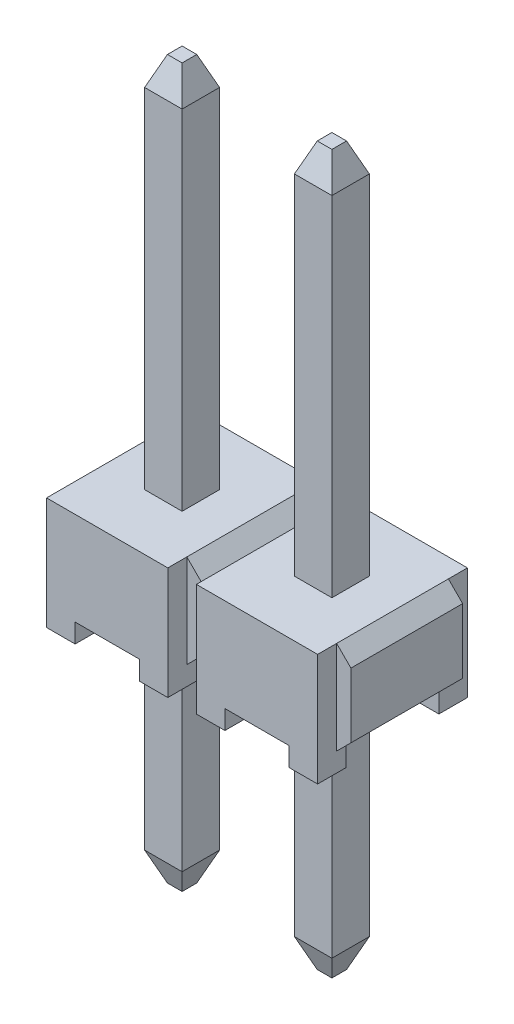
ISO-10303-21;
HEADER;
FILE_DESCRIPTION(('STEP AP214'),'2;1');
FILE_NAME('part.step','',(''),(''),'','','');
FILE_SCHEMA(('AUTOMOTIVE_DESIGN { 1 0 10303 214 1 1 1 1 }'));
ENDSEC;
DATA;
#1=APPLICATION_CONTEXT('core data for automotive mechanical design processes');
#2=APPLICATION_PROTOCOL_DEFINITION('international standard','automotive_design',2000,#1);
#3=PRODUCT_CONTEXT('',#1,'mechanical');
#4=PRODUCT('Part','Part','',(#3));
#5=PRODUCT_RELATED_PRODUCT_CATEGORY('part','',(#4));
#6=PRODUCT_DEFINITION_FORMATION('','',#4);
#7=PRODUCT_DEFINITION_CONTEXT('part definition',#1,'design');
#8=PRODUCT_DEFINITION('design','',#6,#7);
#9=PRODUCT_DEFINITION_SHAPE('','',#8);
#10=(LENGTH_UNIT() NAMED_UNIT(*) SI_UNIT(.MILLI.,.METRE.));
#11=(NAMED_UNIT(*) PLANE_ANGLE_UNIT() SI_UNIT($,.RADIAN.));
#12=(NAMED_UNIT(*) SI_UNIT($,.STERADIAN.) SOLID_ANGLE_UNIT());
#13=UNCERTAINTY_MEASURE_WITH_UNIT(LENGTH_MEASURE(1.E-05),#10,'distance_accuracy_value','');
#14=(GEOMETRIC_REPRESENTATION_CONTEXT(3) GLOBAL_UNCERTAINTY_ASSIGNED_CONTEXT((#13)) GLOBAL_UNIT_ASSIGNED_CONTEXT((#10,
#11,#12)) REPRESENTATION_CONTEXT('',''));
#15=CARTESIAN_POINT('',(0.,0.,0.));
#16=DIRECTION('',(0.,0.,1.));
#17=DIRECTION('',(1.,0.,0.));
#18=AXIS2_PLACEMENT_3D('',#15,#16,#17);
#19=CARTESIAN_POINT('',(-1.99898,4.0703271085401,-1.99898));
#20=DIRECTION('',(-1.,0.,0.));
#21=DIRECTION('',(0.,0.,1.));
#22=AXIS2_PLACEMENT_3D('',#19,#20,#21);
#23=PLANE('',#22);
#24=DIRECTION('',(0.,-1.,0.));
#25=VECTOR('',#24,1.);
#26=CARTESIAN_POINT('',(-1.99898,0.254,-0.381000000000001));
#27=LINE('',#26,#25);
#28=CARTESIAN_POINT('',(-1.99898,0.254,-0.381000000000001));
#29=VERTEX_POINT('',#28);
#30=CARTESIAN_POINT('',(-1.99898,0.,-0.381000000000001));
#31=VERTEX_POINT('',#30);
#32=EDGE_CURVE('E638',#29,#31,#27,.T.);
#33=ORIENTED_EDGE('',*,*,#32,.F.);
#34=DIRECTION('',(0.,0.,1.));
#35=VECTOR('',#34,1.);
#36=CARTESIAN_POINT('',(-1.99898,0.254,-1.99998));
#37=LINE('',#36,#35);
#38=CARTESIAN_POINT('',(-1.99898,0.254,-0.254));
#39=VERTEX_POINT('',#38);
#40=EDGE_CURVE('E849',#29,#39,#37,.T.);
#41=ORIENTED_EDGE('',*,*,#40,.T.);
#42=DIRECTION('',(0.,1.,0.));
#43=VECTOR('',#42,1.);
#44=CARTESIAN_POINT('',(-1.99898,1.4986,-0.254));
#45=LINE('',#44,#43);
#46=CARTESIAN_POINT('',(-1.99898,1.4986,-0.254));
#47=VERTEX_POINT('',#46);
#48=EDGE_CURVE('E699',#39,#47,#45,.T.);
#49=ORIENTED_EDGE('',*,*,#48,.T.);
#50=DIRECTION('',(0.,0.,-1.));
#51=VECTOR('',#50,1.);
#52=CARTESIAN_POINT('',(-1.99898,1.4986,-1.99898));
#53=LINE('',#52,#51);
#54=CARTESIAN_POINT('',(-1.99898,1.4986,0.));
#55=VERTEX_POINT('',#54);
#56=EDGE_CURVE('E684',#55,#47,#53,.T.);
#57=ORIENTED_EDGE('',*,*,#56,.F.);
#58=DIRECTION('',(0.,-1.,0.));
#59=VECTOR('',#58,1.);
#60=CARTESIAN_POINT('',(-1.99898,4.0703271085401,0.));
#61=LINE('',#60,#59);
#62=CARTESIAN_POINT('',(-1.99898,0.,0.));
#63=VERTEX_POINT('',#62);
#64=EDGE_CURVE('E661',#55,#63,#61,.T.);
#65=ORIENTED_EDGE('',*,*,#64,.T.);
#66=DIRECTION('',(0.,0.,-1.));
#67=VECTOR('',#66,1.);
#68=CARTESIAN_POINT('',(-1.99898,0.,-1.99898));
#69=LINE('',#68,#67);
#70=EDGE_CURVE('E653',#63,#31,#69,.T.);
#71=ORIENTED_EDGE('',*,*,#70,.T.);
#72=EDGE_LOOP('',(#33,#41,#49,#57,#65,#71));
#73=FACE_BOUND('',#72,.T.);
#74=ADVANCED_FACE('F33',(#73),#23,.F.);
#75=DIRECTION('',(0.,-1.,0.));
#76=VECTOR('',#75,1.);
#77=CARTESIAN_POINT('',(-1.99898,0.254,-1.61798));
#78=LINE('',#77,#76);
#79=CARTESIAN_POINT('',(-1.99898,0.254,-1.61798));
#80=VERTEX_POINT('',#79);
#81=CARTESIAN_POINT('',(-1.99898,0.,-1.61798));
#82=VERTEX_POINT('',#81);
#83=EDGE_CURVE('E635',#80,#82,#78,.T.);
#84=ORIENTED_EDGE('',*,*,#83,.T.);
#85=CARTESIAN_POINT('',(-1.99898,0.,-1.99898));
#86=VERTEX_POINT('',#85);
#87=EDGE_CURVE('E657',#82,#86,#69,.T.);
#88=ORIENTED_EDGE('',*,*,#87,.T.);
#89=DIRECTION('',(0.,-1.,0.));
#90=VECTOR('',#89,1.);
#91=CARTESIAN_POINT('',(-1.99898,4.0703271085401,-1.99898));
#92=LINE('',#91,#90);
#93=CARTESIAN_POINT('',(-1.99898,1.4986,-1.99898));
#94=VERTEX_POINT('',#93);
#95=EDGE_CURVE('E652',#94,#86,#92,.T.);
#96=ORIENTED_EDGE('',*,*,#95,.F.);
#97=CARTESIAN_POINT('',(-1.99898,1.4986,-1.74498));
#98=VERTEX_POINT('',#97);
#99=EDGE_CURVE('E656',#98,#94,#53,.T.);
#100=ORIENTED_EDGE('',*,*,#99,.F.);
#101=DIRECTION('',(0.,-1.,0.));
#102=VECTOR('',#101,1.);
#103=CARTESIAN_POINT('',(-1.99898,1.4986,-1.74498));
#104=LINE('',#103,#102);
#105=CARTESIAN_POINT('',(-1.99898,0.254,-1.74498));
#106=VERTEX_POINT('',#105);
#107=EDGE_CURVE('E701',#98,#106,#104,.T.);
#108=ORIENTED_EDGE('',*,*,#107,.T.);
#109=EDGE_CURVE('E845',#106,#80,#37,.T.);
#110=ORIENTED_EDGE('',*,*,#109,.T.);
#111=EDGE_LOOP('',(#84,#88,#96,#100,#108,#110));
#112=FACE_BOUND('',#111,.T.);
#113=ADVANCED_FACE('F1128',(#112),#23,.F.);
#114=CARTESIAN_POINT('',(-3.61696,4.0703271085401,-1.99898));
#115=DIRECTION('',(1.,0.,0.));
#116=DIRECTION('',(0.,0.,-1.));
#117=AXIS2_PLACEMENT_3D('',#114,#115,#116);
#118=PLANE('',#117);
#119=DIRECTION('',(0.,-1.,0.));
#120=VECTOR('',#119,1.);
#121=CARTESIAN_POINT('',(-3.61696,0.254,-0.381000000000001));
#122=LINE('',#121,#120);
#123=CARTESIAN_POINT('',(-3.61696,0.254,-0.381000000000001));
#124=VERTEX_POINT('',#123);
#125=CARTESIAN_POINT('',(-3.61696,0.,-0.381000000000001));
#126=VERTEX_POINT('',#125);
#127=EDGE_CURVE('E649',#124,#126,#122,.T.);
#128=ORIENTED_EDGE('',*,*,#127,.T.);
#129=DIRECTION('',(0.,0.,1.));
#130=VECTOR('',#129,1.);
#131=CARTESIAN_POINT('',(-3.61696,0.,-1.99898));
#132=LINE('',#131,#130);
#133=CARTESIAN_POINT('',(-3.61696,0.,0.));
#134=VERTEX_POINT('',#133);
#135=EDGE_CURVE('E667',#126,#134,#132,.T.);
#136=ORIENTED_EDGE('',*,*,#135,.T.);
#137=DIRECTION('',(0.,-1.,0.));
#138=VECTOR('',#137,1.);
#139=CARTESIAN_POINT('',(-3.61696,4.0703271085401,0.));
#140=LINE('',#139,#138);
#141=CARTESIAN_POINT('',(-3.61696,1.4986,0.));
#142=VERTEX_POINT('',#141);
#143=EDGE_CURVE('E666',#142,#134,#140,.T.);
#144=ORIENTED_EDGE('',*,*,#143,.F.);
#145=DIRECTION('',(0.,0.,1.));
#146=VECTOR('',#145,1.);
#147=CARTESIAN_POINT('',(-3.61696,1.4986,-1.99898));
#148=LINE('',#147,#146);
#149=CARTESIAN_POINT('',(-3.61696,1.4986,-0.254));
#150=VERTEX_POINT('',#149);
#151=EDGE_CURVE('E680',#150,#142,#148,.T.);
#152=ORIENTED_EDGE('',*,*,#151,.F.);
#153=DIRECTION('',(0.,-1.,0.));
#154=VECTOR('',#153,1.);
#155=CARTESIAN_POINT('',(-3.61696,1.4986,-0.254));
#156=LINE('',#155,#154);
#157=CARTESIAN_POINT('',(-3.61696,0.254,-0.254));
#158=VERTEX_POINT('',#157);
#159=EDGE_CURVE('E676',#150,#158,#156,.T.);
#160=ORIENTED_EDGE('',*,*,#159,.T.);
#161=DIRECTION('',(0.,0.,1.));
#162=VECTOR('',#161,1.);
#163=CARTESIAN_POINT('',(-3.61696,0.254,-1.99998));
#164=LINE('',#163,#162);
#165=EDGE_CURVE('E807',#124,#158,#164,.T.);
#166=ORIENTED_EDGE('',*,*,#165,.F.);
#167=EDGE_LOOP('',(#128,#136,#144,#152,#160,#166));
#168=FACE_BOUND('',#167,.T.);
#169=ADVANCED_FACE('F1134',(#168),#118,.F.);
#170=DIRECTION('',(0.,-1.,0.));
#171=VECTOR('',#170,1.);
#172=CARTESIAN_POINT('',(-3.61696,0.254,-1.61798));
#173=LINE('',#172,#171);
#174=CARTESIAN_POINT('',(-3.61696,0.254,-1.61798));
#175=VERTEX_POINT('',#174);
#176=CARTESIAN_POINT('',(-3.61696,0.,-1.61798));
#177=VERTEX_POINT('',#176);
#178=EDGE_CURVE('E602',#175,#177,#173,.T.);
#179=ORIENTED_EDGE('',*,*,#178,.F.);
#180=CARTESIAN_POINT('',(-3.61696,0.254,-1.74498));
#181=VERTEX_POINT('',#180);
#182=EDGE_CURVE('E812',#181,#175,#164,.T.);
#183=ORIENTED_EDGE('',*,*,#182,.F.);
#184=DIRECTION('',(0.,1.,0.));
#185=VECTOR('',#184,1.);
#186=CARTESIAN_POINT('',(-3.61696,1.4986,-1.74498));
#187=LINE('',#186,#185);
#188=CARTESIAN_POINT('',(-3.61696,1.4986,-1.74498));
#189=VERTEX_POINT('',#188);
#190=EDGE_CURVE('E697',#181,#189,#187,.T.);
#191=ORIENTED_EDGE('',*,*,#190,.T.);
#192=CARTESIAN_POINT('',(-3.61696,1.4986,-1.99898));
#193=VERTEX_POINT('',#192);
#194=EDGE_CURVE('E677',#193,#189,#148,.T.);
#195=ORIENTED_EDGE('',*,*,#194,.F.);
#196=DIRECTION('',(0.,-1.,0.));
#197=VECTOR('',#196,1.);
#198=CARTESIAN_POINT('',(-3.61696,4.0703271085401,-1.99898));
#199=LINE('',#198,#197);
#200=CARTESIAN_POINT('',(-3.61696,0.,-1.99898));
#201=VERTEX_POINT('',#200);
#202=EDGE_CURVE('E671',#193,#201,#199,.T.);
#203=ORIENTED_EDGE('',*,*,#202,.T.);
#204=EDGE_CURVE('E663',#201,#177,#132,.T.);
#205=ORIENTED_EDGE('',*,*,#204,.T.);
#206=EDGE_LOOP('',(#179,#183,#191,#195,#203,#205));
#207=FACE_BOUND('',#206,.T.);
#208=ADVANCED_FACE('F1148',(#207),#118,.F.);
#209=CARTESIAN_POINT('',(-3.61696,4.0703271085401,-1.99898));
#210=DIRECTION('',(0.,0.,1.));
#211=DIRECTION('',(1.,0.,0.));
#212=AXIS2_PLACEMENT_3D('',#209,#210,#211);
#213=PLANE('',#212);
#214=DIRECTION('',(0.,-1.,0.));
#215=VECTOR('',#214,1.);
#216=CARTESIAN_POINT('',(-2.37998,0.254,-1.99898));
#217=LINE('',#216,#215);
#218=CARTESIAN_POINT('',(-2.37998,0.254,-1.99898));
#219=VERTEX_POINT('',#218);
#220=CARTESIAN_POINT('',(-2.37998,0.,-1.99898));
#221=VERTEX_POINT('',#220);
#222=EDGE_CURVE('E631',#219,#221,#217,.T.);
#223=ORIENTED_EDGE('',*,*,#222,.F.);
#224=DIRECTION('',(-1.,0.,0.));
#225=VECTOR('',#224,1.);
#226=CARTESIAN_POINT('',(-2.37998,0.254,-1.99898));
#227=LINE('',#226,#225);
#228=CARTESIAN_POINT('',(-3.23596,0.254,-1.99898));
#229=VERTEX_POINT('',#228);
#230=EDGE_CURVE('E595',#219,#229,#227,.T.);
#231=ORIENTED_EDGE('',*,*,#230,.T.);
#232=DIRECTION('',(0.,-1.,0.));
#233=VECTOR('',#232,1.);
#234=CARTESIAN_POINT('',(-3.23596,0.254,-1.99898));
#235=LINE('',#234,#233);
#236=CARTESIAN_POINT('',(-3.23596,0.,-1.99898));
#237=VERTEX_POINT('',#236);
#238=EDGE_CURVE('E628',#229,#237,#235,.T.);
#239=ORIENTED_EDGE('',*,*,#238,.T.);
#240=DIRECTION('',(-1.,0.,0.));
#241=VECTOR('',#240,1.);
#242=CARTESIAN_POINT('',(-3.61696,0.,-1.99898));
#243=LINE('',#242,#241);
#244=EDGE_CURVE('E672',#237,#201,#243,.T.);
#245=ORIENTED_EDGE('',*,*,#244,.T.);
#246=ORIENTED_EDGE('',*,*,#202,.F.);
#247=DIRECTION('',(-1.,0.,0.));
#248=VECTOR('',#247,1.);
#249=CARTESIAN_POINT('',(-3.61696,1.4986,-1.99898));
#250=LINE('',#249,#248);
#251=EDGE_CURVE('E681',#94,#193,#250,.T.);
#252=ORIENTED_EDGE('',*,*,#251,.F.);
#253=ORIENTED_EDGE('',*,*,#95,.T.);
#254=EDGE_CURVE('E668',#86,#221,#243,.T.);
#255=ORIENTED_EDGE('',*,*,#254,.T.);
#256=EDGE_LOOP('',(#223,#231,#239,#245,#246,#252,#253,#255));
#257=FACE_BOUND('',#256,.T.);
#258=ADVANCED_FACE('F1144',(#257),#213,.F.);
#259=CARTESIAN_POINT('',(-3.61696,4.0703271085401,0.));
#260=DIRECTION('',(0.,0.,-1.));
#261=DIRECTION('',(-1.,0.,0.));
#262=AXIS2_PLACEMENT_3D('',#259,#260,#261);
#263=PLANE('',#262);
#264=DIRECTION('',(0.,-1.,0.));
#265=VECTOR('',#264,1.);
#266=CARTESIAN_POINT('',(-3.23596,0.254,0.));
#267=LINE('',#266,#265);
#268=CARTESIAN_POINT('',(-3.23596,0.254,0.));
#269=VERTEX_POINT('',#268);
#270=CARTESIAN_POINT('',(-3.23596,0.,0.));
#271=VERTEX_POINT('',#270);
#272=EDGE_CURVE('E645',#269,#271,#267,.T.);
#273=ORIENTED_EDGE('',*,*,#272,.F.);
#274=DIRECTION('',(1.,0.,0.));
#275=VECTOR('',#274,1.);
#276=CARTESIAN_POINT('',(-3.23596,0.254,0.));
#277=LINE('',#276,#275);
#278=CARTESIAN_POINT('',(-2.37998,0.254,0.));
#279=VERTEX_POINT('',#278);
#280=EDGE_CURVE('E581',#269,#279,#277,.T.);
#281=ORIENTED_EDGE('',*,*,#280,.T.);
#282=DIRECTION('',(0.,-1.,0.));
#283=VECTOR('',#282,1.);
#284=CARTESIAN_POINT('',(-2.37998,0.254,0.));
#285=LINE('',#284,#283);
#286=CARTESIAN_POINT('',(-2.37998,0.,0.));
#287=VERTEX_POINT('',#286);
#288=EDGE_CURVE('E642',#279,#287,#285,.T.);
#289=ORIENTED_EDGE('',*,*,#288,.T.);
#290=DIRECTION('',(1.,0.,0.));
#291=VECTOR('',#290,1.);
#292=CARTESIAN_POINT('',(-3.61696,0.,0.));
#293=LINE('',#292,#291);
#294=EDGE_CURVE('E662',#287,#63,#293,.T.);
#295=ORIENTED_EDGE('',*,*,#294,.T.);
#296=ORIENTED_EDGE('',*,*,#64,.F.);
#297=DIRECTION('',(1.,0.,0.));
#298=VECTOR('',#297,1.);
#299=CARTESIAN_POINT('',(-3.61696,1.4986,0.));
#300=LINE('',#299,#298);
#301=EDGE_CURVE('E673',#142,#55,#300,.T.);
#302=ORIENTED_EDGE('',*,*,#301,.F.);
#303=ORIENTED_EDGE('',*,*,#143,.T.);
#304=EDGE_CURVE('E658',#134,#271,#293,.T.);
#305=ORIENTED_EDGE('',*,*,#304,.T.);
#306=EDGE_LOOP('',(#273,#281,#289,#295,#296,#302,#303,#305));
#307=FACE_BOUND('',#306,.T.);
#308=ADVANCED_FACE('F1141',(#307),#263,.F.);
#309=CARTESIAN_POINT('',(-1.99898,0.,-1.99898));
#310=DIRECTION('',(0.,-1.,0.));
#311=DIRECTION('',(0.,0.,-1.));
#312=AXIS2_PLACEMENT_3D('',#309,#310,#311);
#313=PLANE('',#312);
#314=ORIENTED_EDGE('',*,*,#135,.F.);
#315=DIRECTION('',(1.,0.,0.));
#316=VECTOR('',#315,1.);
#317=CARTESIAN_POINT('',(-3.23596,0.,-0.381000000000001));
#318=LINE('',#317,#316);
#319=CARTESIAN_POINT('',(-3.23596,0.,-0.381000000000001));
#320=VERTEX_POINT('',#319);
#321=EDGE_CURVE('E572',#126,#320,#318,.T.);
#322=ORIENTED_EDGE('',*,*,#321,.T.);
#323=DIRECTION('',(0.,0.,1.));
#324=VECTOR('',#323,1.);
#325=CARTESIAN_POINT('',(-3.23596,0.,0.));
#326=LINE('',#325,#324);
#327=EDGE_CURVE('E605',#320,#271,#326,.T.);
#328=ORIENTED_EDGE('',*,*,#327,.T.);
#329=ORIENTED_EDGE('',*,*,#304,.F.);
#330=EDGE_LOOP('',(#314,#322,#328,#329));
#331=FACE_BOUND('',#330,.T.);
#332=ADVANCED_FACE('F1139',(#331),#313,.T.);
#333=ORIENTED_EDGE('',*,*,#294,.F.);
#334=DIRECTION('',(0.,0.,-1.));
#335=VECTOR('',#334,1.);
#336=CARTESIAN_POINT('',(-2.37998,0.,0.));
#337=LINE('',#336,#335);
#338=CARTESIAN_POINT('',(-2.37998,0.,-0.381000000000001));
#339=VERTEX_POINT('',#338);
#340=EDGE_CURVE('E608',#287,#339,#337,.T.);
#341=ORIENTED_EDGE('',*,*,#340,.T.);
#342=DIRECTION('',(1.,0.,0.));
#343=VECTOR('',#342,1.);
#344=CARTESIAN_POINT('',(-1.99898,0.,-0.381000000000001));
#345=LINE('',#344,#343);
#346=EDGE_CURVE('E611',#339,#31,#345,.T.);
#347=ORIENTED_EDGE('',*,*,#346,.T.);
#348=ORIENTED_EDGE('',*,*,#70,.F.);
#349=EDGE_LOOP('',(#333,#341,#347,#348));
#350=FACE_BOUND('',#349,.T.);
#351=ADVANCED_FACE('F1815',(#350),#313,.T.);
#352=ORIENTED_EDGE('',*,*,#87,.F.);
#353=DIRECTION('',(-1.,0.,0.));
#354=VECTOR('',#353,1.);
#355=CARTESIAN_POINT('',(-1.99898,0.,-1.61798));
#356=LINE('',#355,#354);
#357=CARTESIAN_POINT('',(-2.37998,0.,-1.61798));
#358=VERTEX_POINT('',#357);
#359=EDGE_CURVE('E614',#82,#358,#356,.T.);
#360=ORIENTED_EDGE('',*,*,#359,.T.);
#361=DIRECTION('',(0.,0.,-1.));
#362=VECTOR('',#361,1.);
#363=CARTESIAN_POINT('',(-2.37998,0.,-1.61798));
#364=LINE('',#363,#362);
#365=EDGE_CURVE('E617',#358,#221,#364,.T.);
#366=ORIENTED_EDGE('',*,*,#365,.T.);
#367=ORIENTED_EDGE('',*,*,#254,.F.);
#368=EDGE_LOOP('',(#352,#360,#366,#367));
#369=FACE_BOUND('',#368,.T.);
#370=ADVANCED_FACE('F1806',(#369),#313,.T.);
#371=ORIENTED_EDGE('',*,*,#244,.F.);
#372=DIRECTION('',(0.,0.,1.));
#373=VECTOR('',#372,1.);
#374=CARTESIAN_POINT('',(-3.23596,0.,-1.61798));
#375=LINE('',#374,#373);
#376=CARTESIAN_POINT('',(-3.23596,0.,-1.61798));
#377=VERTEX_POINT('',#376);
#378=EDGE_CURVE('E620',#237,#377,#375,.T.);
#379=ORIENTED_EDGE('',*,*,#378,.T.);
#380=DIRECTION('',(-1.,0.,0.));
#381=VECTOR('',#380,1.);
#382=CARTESIAN_POINT('',(-3.23596,0.,-1.61798));
#383=LINE('',#382,#381);
#384=EDGE_CURVE('E577',#377,#177,#383,.T.);
#385=ORIENTED_EDGE('',*,*,#384,.T.);
#386=ORIENTED_EDGE('',*,*,#204,.F.);
#387=EDGE_LOOP('',(#371,#379,#385,#386));
#388=FACE_BOUND('',#387,.T.);
#389=ADVANCED_FACE('F1242',(#388),#313,.T.);
#390=CARTESIAN_POINT('',(-3.80746,1.4986,-1.74498));
#391=DIRECTION('',(0.,0.,1.));
#392=DIRECTION('',(0.,-1.,0.));
#393=AXIS2_PLACEMENT_3D('',#390,#391,#392);
#394=PLANE('',#393);
#395=ORIENTED_EDGE('',*,*,#190,.F.);
#396=DIRECTION('',(0.707106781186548,-0.707106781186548,0.));
#397=VECTOR('',#396,1.);
#398=CARTESIAN_POINT('',(-3.61696,0.254,-1.74498));
#399=LINE('',#398,#397);
#400=CARTESIAN_POINT('',(-3.80746,0.4445,-1.74498));
#401=VERTEX_POINT('',#400);
#402=EDGE_CURVE('E816',#401,#181,#399,.T.);
#403=ORIENTED_EDGE('',*,*,#402,.F.);
#404=DIRECTION('',(0.,-1.,0.));
#405=VECTOR('',#404,1.);
#406=CARTESIAN_POINT('',(-3.80746,1.4986,-1.74498));
#407=LINE('',#406,#405);
#408=CARTESIAN_POINT('',(-3.80746,1.3081,-1.74498));
#409=VERTEX_POINT('',#408);
#410=EDGE_CURVE('E872',#409,#401,#407,.T.);
#411=ORIENTED_EDGE('',*,*,#410,.F.);
#412=DIRECTION('',(-0.707106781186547,-0.707106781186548,0.));
#413=VECTOR('',#412,1.);
#414=CARTESIAN_POINT('',(-3.61696,1.4986,-1.74498));
#415=LINE('',#414,#413);
#416=EDGE_CURVE('E805',#189,#409,#415,.T.);
#417=ORIENTED_EDGE('',*,*,#416,.F.);
#418=EDGE_LOOP('',(#395,#403,#411,#417));
#419=FACE_BOUND('',#418,.T.);
#420=ADVANCED_FACE('F1239',(#419),#394,.F.);
#421=ORIENTED_EDGE('',*,*,#107,.F.);
#422=DIRECTION('',(-0.707106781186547,0.707106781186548,0.));
#423=VECTOR('',#422,1.);
#424=CARTESIAN_POINT('',(-1.80848,1.3081,-1.74498));
#425=LINE('',#424,#423);
#426=CARTESIAN_POINT('',(-1.80848,1.3081,-1.74498));
#427=VERTEX_POINT('',#426);
#428=EDGE_CURVE('E821',#427,#98,#425,.T.);
#429=ORIENTED_EDGE('',*,*,#428,.F.);
#430=DIRECTION('',(-0.707106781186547,-0.707106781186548,0.));
#431=VECTOR('',#430,1.);
#432=CARTESIAN_POINT('',(-1.61798,1.4986,-1.74498));
#433=LINE('',#432,#431);
#434=CARTESIAN_POINT('',(-1.61798,1.4986,-1.74498));
#435=VERTEX_POINT('',#434);
#436=EDGE_CURVE('E835',#435,#427,#433,.T.);
#437=ORIENTED_EDGE('',*,*,#436,.F.);
#438=DIRECTION('',(0.,-1.,0.));
#439=VECTOR('',#438,1.);
#440=CARTESIAN_POINT('',(-1.61798,4.0703271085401,-1.74498));
#441=LINE('',#440,#439);
#442=CARTESIAN_POINT('',(-1.61798,0.254,-1.74498));
#443=VERTEX_POINT('',#442);
#444=EDGE_CURVE('E890',#435,#443,#441,.T.);
#445=ORIENTED_EDGE('',*,*,#444,.T.);
#446=DIRECTION('',(0.707106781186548,-0.707106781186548,0.));
#447=VECTOR('',#446,1.);
#448=CARTESIAN_POINT('',(-1.61798,0.254,-1.74498));
#449=LINE('',#448,#447);
#450=CARTESIAN_POINT('',(-1.80848,0.4445,-1.74498));
#451=VERTEX_POINT('',#450);
#452=EDGE_CURVE('E853',#451,#443,#449,.T.);
#453=ORIENTED_EDGE('',*,*,#452,.F.);
#454=DIRECTION('',(0.707106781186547,0.707106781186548,0.));
#455=VECTOR('',#454,1.);
#456=CARTESIAN_POINT('',(-1.80848,0.4445,-1.74498));
#457=LINE('',#456,#455);
#458=EDGE_CURVE('E841',#106,#451,#457,.T.);
#459=ORIENTED_EDGE('',*,*,#458,.F.);
#460=EDGE_LOOP('',(#421,#429,#437,#445,#453,#459));
#461=FACE_BOUND('',#460,.T.);
#462=ADVANCED_FACE('F1237',(#461),#394,.F.);
#463=CARTESIAN_POINT('',(-3.80746,1.4986,-0.254));
#464=DIRECTION('',(0.,0.,-1.));
#465=DIRECTION('',(0.,1.,0.));
#466=AXIS2_PLACEMENT_3D('',#463,#464,#465);
#467=PLANE('',#466);
#468=ORIENTED_EDGE('',*,*,#159,.F.);
#469=DIRECTION('',(0.707106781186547,0.707106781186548,0.));
#470=VECTOR('',#469,1.);
#471=CARTESIAN_POINT('',(-3.61696,1.4986,-0.254));
#472=LINE('',#471,#470);
#473=CARTESIAN_POINT('',(-3.80746,1.3081,-0.254));
#474=VERTEX_POINT('',#473);
#475=EDGE_CURVE('E801',#474,#150,#472,.T.);
#476=ORIENTED_EDGE('',*,*,#475,.F.);
#477=DIRECTION('',(0.,1.,0.));
#478=VECTOR('',#477,1.);
#479=CARTESIAN_POINT('',(-3.80746,1.4986,-0.254));
#480=LINE('',#479,#478);
#481=CARTESIAN_POINT('',(-3.80746,0.4445,-0.254));
#482=VERTEX_POINT('',#481);
#483=EDGE_CURVE('E874',#482,#474,#480,.T.);
#484=ORIENTED_EDGE('',*,*,#483,.F.);
#485=DIRECTION('',(-0.707106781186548,0.707106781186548,0.));
#486=VECTOR('',#485,1.);
#487=CARTESIAN_POINT('',(-3.61696,0.254,-0.254));
#488=LINE('',#487,#486);
#489=EDGE_CURVE('E811',#158,#482,#488,.T.);
#490=ORIENTED_EDGE('',*,*,#489,.F.);
#491=EDGE_LOOP('',(#468,#476,#484,#490));
#492=FACE_BOUND('',#491,.T.);
#493=ADVANCED_FACE('F1233',(#492),#467,.F.);
#494=ORIENTED_EDGE('',*,*,#48,.F.);
#495=DIRECTION('',(-0.707106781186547,-0.707106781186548,0.));
#496=VECTOR('',#495,1.);
#497=CARTESIAN_POINT('',(-1.80848,0.4445,-0.254));
#498=LINE('',#497,#496);
#499=CARTESIAN_POINT('',(-1.80848,0.4445,-0.254));
#500=VERTEX_POINT('',#499);
#501=EDGE_CURVE('E838',#500,#39,#498,.T.);
#502=ORIENTED_EDGE('',*,*,#501,.F.);
#503=DIRECTION('',(-0.707106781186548,0.707106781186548,0.));
#504=VECTOR('',#503,1.);
#505=CARTESIAN_POINT('',(-1.61798,0.254,-0.254));
#506=LINE('',#505,#504);
#507=CARTESIAN_POINT('',(-1.61798,0.254,-0.254));
#508=VERTEX_POINT('',#507);
#509=EDGE_CURVE('E848',#508,#500,#506,.T.);
#510=ORIENTED_EDGE('',*,*,#509,.F.);
#511=DIRECTION('',(0.,1.,0.));
#512=VECTOR('',#511,1.);
#513=CARTESIAN_POINT('',(-1.61798,4.0703271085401,-0.254000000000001));
#514=LINE('',#513,#512);
#515=CARTESIAN_POINT('',(-1.61798,1.4986,-0.254));
#516=VERTEX_POINT('',#515);
#517=EDGE_CURVE('E884',#508,#516,#514,.T.);
#518=ORIENTED_EDGE('',*,*,#517,.T.);
#519=DIRECTION('',(0.707106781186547,0.707106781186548,0.));
#520=VECTOR('',#519,1.);
#521=CARTESIAN_POINT('',(-1.61798,1.4986,-0.254));
#522=LINE('',#521,#520);
#523=CARTESIAN_POINT('',(-1.80848,1.3081,-0.254));
#524=VERTEX_POINT('',#523);
#525=EDGE_CURVE('E828',#524,#516,#522,.T.);
#526=ORIENTED_EDGE('',*,*,#525,.F.);
#527=DIRECTION('',(0.707106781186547,-0.707106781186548,0.));
#528=VECTOR('',#527,1.);
#529=CARTESIAN_POINT('',(-1.80848,1.3081,-0.254));
#530=LINE('',#529,#528);
#531=EDGE_CURVE('E819',#47,#524,#530,.T.);
#532=ORIENTED_EDGE('',*,*,#531,.F.);
#533=EDGE_LOOP('',(#494,#502,#510,#518,#526,#532));
#534=FACE_BOUND('',#533,.T.);
#535=ADVANCED_FACE('F1236',(#534),#467,.F.);
#536=CARTESIAN_POINT('',(-1.61798,4.0703271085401,-1.99898));
#537=DIRECTION('',(1.,0.,0.));
#538=DIRECTION('',(0.,0.,-1.));
#539=AXIS2_PLACEMENT_3D('',#536,#537,#538);
#540=PLANE('',#539);
#541=DIRECTION('',(0.,-1.,0.));
#542=VECTOR('',#541,1.);
#543=CARTESIAN_POINT('',(-1.61798,0.254,-0.381000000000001));
#544=LINE('',#543,#542);
#545=CARTESIAN_POINT('',(-1.61798,0.254,-0.381000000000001));
#546=VERTEX_POINT('',#545);
#547=CARTESIAN_POINT('',(-1.61798,0.,-0.381000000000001));
#548=VERTEX_POINT('',#547);
#549=EDGE_CURVE('E794',#546,#548,#544,.T.);
#550=ORIENTED_EDGE('',*,*,#549,.T.);
#551=DIRECTION('',(0.,0.,1.));
#552=VECTOR('',#551,1.);
#553=CARTESIAN_POINT('',(-1.61798,0.,-1.99898));
#554=LINE('',#553,#552);
#555=CARTESIAN_POINT('',(-1.61798,0.,0.));
#556=VERTEX_POINT('',#555);
#557=EDGE_CURVE('E912',#548,#556,#554,.T.);
#558=ORIENTED_EDGE('',*,*,#557,.T.);
#559=DIRECTION('',(0.,-1.,0.));
#560=VECTOR('',#559,1.);
#561=CARTESIAN_POINT('',(-1.61798,4.0703271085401,0.));
#562=LINE('',#561,#560);
#563=CARTESIAN_POINT('',(-1.61798,1.4986,0.));
#564=VERTEX_POINT('',#563);
#565=EDGE_CURVE('E911',#564,#556,#562,.T.);
#566=ORIENTED_EDGE('',*,*,#565,.F.);
#567=DIRECTION('',(0.,0.,1.));
#568=VECTOR('',#567,1.);
#569=CARTESIAN_POINT('',(-1.61798,1.4986,-1.99898));
#570=LINE('',#569,#568);
#571=EDGE_CURVE('E925',#516,#564,#570,.T.);
#572=ORIENTED_EDGE('',*,*,#571,.F.);
#573=ORIENTED_EDGE('',*,*,#517,.F.);
#574=DIRECTION('',(0.,0.,1.));
#575=VECTOR('',#574,1.);
#576=CARTESIAN_POINT('',(-1.61798,0.254,-1.99898));
#577=LINE('',#576,#575);
#578=EDGE_CURVE('E893',#546,#508,#577,.T.);
#579=ORIENTED_EDGE('',*,*,#578,.F.);
#580=EDGE_LOOP('',(#550,#558,#566,#572,#573,#579));
#581=FACE_BOUND('',#580,.T.);
#582=ADVANCED_FACE('F1261',(#581),#540,.F.);
#583=DIRECTION('',(0.,-1.,0.));
#584=VECTOR('',#583,1.);
#585=CARTESIAN_POINT('',(-1.61798,0.254,-1.61798));
#586=LINE('',#585,#584);
#587=CARTESIAN_POINT('',(-1.61798,0.254,-1.61798));
#588=VERTEX_POINT('',#587);
#589=CARTESIAN_POINT('',(-1.61798,0.,-1.61798));
#590=VERTEX_POINT('',#589);
#591=EDGE_CURVE('E747',#588,#590,#586,.T.);
#592=ORIENTED_EDGE('',*,*,#591,.F.);
#593=EDGE_CURVE('E894',#443,#588,#577,.T.);
#594=ORIENTED_EDGE('',*,*,#593,.F.);
#595=ORIENTED_EDGE('',*,*,#444,.F.);
#596=CARTESIAN_POINT('',(-1.61798,1.4986,-1.99898));
#597=VERTEX_POINT('',#596);
#598=EDGE_CURVE('E922',#597,#435,#570,.T.);
#599=ORIENTED_EDGE('',*,*,#598,.F.);
#600=DIRECTION('',(0.,-1.,0.));
#601=VECTOR('',#600,1.);
#602=CARTESIAN_POINT('',(-1.61798,4.0703271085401,-1.99898));
#603=LINE('',#602,#601);
#604=CARTESIAN_POINT('',(-1.61798,0.,-1.99898));
#605=VERTEX_POINT('',#604);
#606=EDGE_CURVE('E916',#597,#605,#603,.T.);
#607=ORIENTED_EDGE('',*,*,#606,.T.);
#608=EDGE_CURVE('E908',#605,#590,#554,.T.);
#609=ORIENTED_EDGE('',*,*,#608,.T.);
#610=EDGE_LOOP('',(#592,#594,#595,#599,#607,#609));
#611=FACE_BOUND('',#610,.T.);
#612=ADVANCED_FACE('F1255',(#611),#540,.F.);
#613=CARTESIAN_POINT('',(0.,4.0703271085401,-1.99898));
#614=DIRECTION('',(-1.,0.,0.));
#615=DIRECTION('',(0.,0.,1.));
#616=AXIS2_PLACEMENT_3D('',#613,#614,#615);
#617=PLANE('',#616);
#618=DIRECTION('',(0.,-1.,0.));
#619=VECTOR('',#618,1.);
#620=CARTESIAN_POINT('',(0.,0.254,-0.381000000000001));
#621=LINE('',#620,#619);
#622=CARTESIAN_POINT('',(0.,0.254,-0.381000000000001));
#623=VERTEX_POINT('',#622);
#624=CARTESIAN_POINT('',(0.,0.,-0.381000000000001));
#625=VERTEX_POINT('',#624);
#626=EDGE_CURVE('E783',#623,#625,#621,.T.);
#627=ORIENTED_EDGE('',*,*,#626,.F.);
#628=DIRECTION('',(0.,0.,-1.));
#629=VECTOR('',#628,1.);
#630=CARTESIAN_POINT('',(0.,0.254,-1.99898));
#631=LINE('',#630,#629);
#632=CARTESIAN_POINT('',(0.,0.254,-0.254));
#633=VERTEX_POINT('',#632);
#634=EDGE_CURVE('E940',#633,#623,#631,.T.);
#635=ORIENTED_EDGE('',*,*,#634,.F.);
#636=DIRECTION('',(0.,-1.,0.));
#637=VECTOR('',#636,1.);
#638=CARTESIAN_POINT('',(0.,4.0703271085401,-0.254000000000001));
#639=LINE('',#638,#637);
#640=CARTESIAN_POINT('',(0.,1.4986,-0.254));
#641=VERTEX_POINT('',#640);
#642=EDGE_CURVE('E878',#641,#633,#639,.T.);
#643=ORIENTED_EDGE('',*,*,#642,.F.);
#644=DIRECTION('',(0.,0.,-1.));
#645=VECTOR('',#644,1.);
#646=CARTESIAN_POINT('',(0.,1.4986,-1.99898));
#647=LINE('',#646,#645);
#648=CARTESIAN_POINT('',(0.,1.4986,0.));
#649=VERTEX_POINT('',#648);
#650=EDGE_CURVE('E929',#649,#641,#647,.T.);
#651=ORIENTED_EDGE('',*,*,#650,.F.);
#652=DIRECTION('',(0.,-1.,0.));
#653=VECTOR('',#652,1.);
#654=CARTESIAN_POINT('',(0.,4.0703271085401,0.));
#655=LINE('',#654,#653);
#656=CARTESIAN_POINT('',(0.,0.,0.));
#657=VERTEX_POINT('',#656);
#658=EDGE_CURVE('E906',#649,#657,#655,.T.);
#659=ORIENTED_EDGE('',*,*,#658,.T.);
#660=DIRECTION('',(0.,0.,-1.));
#661=VECTOR('',#660,1.);
#662=CARTESIAN_POINT('',(0.,0.,-1.99898));
#663=LINE('',#662,#661);
#664=EDGE_CURVE('E898',#657,#625,#663,.T.);
#665=ORIENTED_EDGE('',*,*,#664,.T.);
#666=EDGE_LOOP('',(#627,#635,#643,#651,#659,#665));
#667=FACE_BOUND('',#666,.T.);
#668=ADVANCED_FACE('F1251',(#667),#617,.F.);
#669=DIRECTION('',(0.,-1.,0.));
#670=VECTOR('',#669,1.);
#671=CARTESIAN_POINT('',(0.,0.254,-1.61798));
#672=LINE('',#671,#670);
#673=CARTESIAN_POINT('',(0.,0.254,-1.61798));
#674=VERTEX_POINT('',#673);
#675=CARTESIAN_POINT('',(0.,0.,-1.61798));
#676=VERTEX_POINT('',#675);
#677=EDGE_CURVE('E780',#674,#676,#672,.T.);
#678=ORIENTED_EDGE('',*,*,#677,.T.);
#679=CARTESIAN_POINT('',(0.,0.,-1.99898));
#680=VERTEX_POINT('',#679);
#681=EDGE_CURVE('E902',#676,#680,#663,.T.);
#682=ORIENTED_EDGE('',*,*,#681,.T.);
#683=DIRECTION('',(0.,-1.,0.));
#684=VECTOR('',#683,1.);
#685=CARTESIAN_POINT('',(0.,4.0703271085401,-1.99898));
#686=LINE('',#685,#684);
#687=CARTESIAN_POINT('',(0.,1.4986,-1.99898));
#688=VERTEX_POINT('',#687);
#689=EDGE_CURVE('E897',#688,#680,#686,.T.);
#690=ORIENTED_EDGE('',*,*,#689,.F.);
#691=CARTESIAN_POINT('',(0.,1.4986,-1.74498));
#692=VERTEX_POINT('',#691);
#693=EDGE_CURVE('E901',#692,#688,#647,.T.);
#694=ORIENTED_EDGE('',*,*,#693,.F.);
#695=DIRECTION('',(0.,1.,0.));
#696=VECTOR('',#695,1.);
#697=CARTESIAN_POINT('',(0.,4.0703271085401,-1.74498));
#698=LINE('',#697,#696);
#699=CARTESIAN_POINT('',(0.,0.254,-1.74498));
#700=VERTEX_POINT('',#699);
#701=EDGE_CURVE('E887',#700,#692,#698,.T.);
#702=ORIENTED_EDGE('',*,*,#701,.F.);
#703=EDGE_CURVE('E921',#674,#700,#631,.T.);
#704=ORIENTED_EDGE('',*,*,#703,.F.);
#705=EDGE_LOOP('',(#678,#682,#690,#694,#702,#704));
#706=FACE_BOUND('',#705,.T.);
#707=ADVANCED_FACE('F1254',(#706),#617,.F.);
#708=CARTESIAN_POINT('',(-1.61798,4.0703271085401,-1.99898));
#709=DIRECTION('',(0.,0.,1.));
#710=DIRECTION('',(1.,0.,0.));
#711=AXIS2_PLACEMENT_3D('',#708,#709,#710);
#712=PLANE('',#711);
#713=DIRECTION('',(0.,-1.,0.));
#714=VECTOR('',#713,1.);
#715=CARTESIAN_POINT('',(-0.381,0.254,-1.99898));
#716=LINE('',#715,#714);
#717=CARTESIAN_POINT('',(-0.381,0.254,-1.99898));
#718=VERTEX_POINT('',#717);
#719=CARTESIAN_POINT('',(-0.381,0.,-1.99898));
#720=VERTEX_POINT('',#719);
#721=EDGE_CURVE('E776',#718,#720,#716,.T.);
#722=ORIENTED_EDGE('',*,*,#721,.F.);
#723=DIRECTION('',(-1.,0.,0.));
#724=VECTOR('',#723,1.);
#725=CARTESIAN_POINT('',(-0.381,0.254,-1.99898));
#726=LINE('',#725,#724);
#727=CARTESIAN_POINT('',(-1.23698,0.254,-1.99898));
#728=VERTEX_POINT('',#727);
#729=EDGE_CURVE('E740',#718,#728,#726,.T.);
#730=ORIENTED_EDGE('',*,*,#729,.T.);
#731=DIRECTION('',(0.,-1.,0.));
#732=VECTOR('',#731,1.);
#733=CARTESIAN_POINT('',(-1.23698,0.254,-1.99898));
#734=LINE('',#733,#732);
#735=CARTESIAN_POINT('',(-1.23698,0.,-1.99898));
#736=VERTEX_POINT('',#735);
#737=EDGE_CURVE('E773',#728,#736,#734,.T.);
#738=ORIENTED_EDGE('',*,*,#737,.T.);
#739=DIRECTION('',(-1.,0.,0.));
#740=VECTOR('',#739,1.);
#741=CARTESIAN_POINT('',(-1.61798,0.,-1.99898));
#742=LINE('',#741,#740);
#743=EDGE_CURVE('E917',#736,#605,#742,.T.);
#744=ORIENTED_EDGE('',*,*,#743,.T.);
#745=ORIENTED_EDGE('',*,*,#606,.F.);
#746=DIRECTION('',(-1.,0.,0.));
#747=VECTOR('',#746,1.);
#748=CARTESIAN_POINT('',(-1.61798,1.4986,-1.99898));
#749=LINE('',#748,#747);
#750=EDGE_CURVE('E926',#688,#597,#749,.T.);
#751=ORIENTED_EDGE('',*,*,#750,.F.);
#752=ORIENTED_EDGE('',*,*,#689,.T.);
#753=EDGE_CURVE('E913',#680,#720,#742,.T.);
#754=ORIENTED_EDGE('',*,*,#753,.T.);
#755=EDGE_LOOP('',(#722,#730,#738,#744,#745,#751,#752,#754));
#756=FACE_BOUND('',#755,.T.);
#757=ADVANCED_FACE('F1259',(#756),#712,.F.);
#758=CARTESIAN_POINT('',(-1.61798,4.0703271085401,0.));
#759=DIRECTION('',(0.,0.,-1.));
#760=DIRECTION('',(-1.,0.,0.));
#761=AXIS2_PLACEMENT_3D('',#758,#759,#760);
#762=PLANE('',#761);
#763=DIRECTION('',(0.,-1.,0.));
#764=VECTOR('',#763,1.);
#765=CARTESIAN_POINT('',(-1.23698,0.254,0.));
#766=LINE('',#765,#764);
#767=CARTESIAN_POINT('',(-1.23698,0.254,0.));
#768=VERTEX_POINT('',#767);
#769=CARTESIAN_POINT('',(-1.23698,0.,0.));
#770=VERTEX_POINT('',#769);
#771=EDGE_CURVE('E790',#768,#770,#766,.T.);
#772=ORIENTED_EDGE('',*,*,#771,.F.);
#773=DIRECTION('',(1.,0.,0.));
#774=VECTOR('',#773,1.);
#775=CARTESIAN_POINT('',(-1.23698,0.254,0.));
#776=LINE('',#775,#774);
#777=CARTESIAN_POINT('',(-0.381,0.254,0.));
#778=VERTEX_POINT('',#777);
#779=EDGE_CURVE('E726',#768,#778,#776,.T.);
#780=ORIENTED_EDGE('',*,*,#779,.T.);
#781=DIRECTION('',(0.,-1.,0.));
#782=VECTOR('',#781,1.);
#783=CARTESIAN_POINT('',(-0.381,0.254,0.));
#784=LINE('',#783,#782);
#785=CARTESIAN_POINT('',(-0.381,0.,0.));
#786=VERTEX_POINT('',#785);
#787=EDGE_CURVE('E787',#778,#786,#784,.T.);
#788=ORIENTED_EDGE('',*,*,#787,.T.);
#789=DIRECTION('',(1.,0.,0.));
#790=VECTOR('',#789,1.);
#791=CARTESIAN_POINT('',(-1.61798,0.,0.));
#792=LINE('',#791,#790);
#793=EDGE_CURVE('E907',#786,#657,#792,.T.);
#794=ORIENTED_EDGE('',*,*,#793,.T.);
#795=ORIENTED_EDGE('',*,*,#658,.F.);
#796=DIRECTION('',(1.,0.,0.));
#797=VECTOR('',#796,1.);
#798=CARTESIAN_POINT('',(-1.61798,1.4986,0.));
#799=LINE('',#798,#797);
#800=EDGE_CURVE('E918',#564,#649,#799,.T.);
#801=ORIENTED_EDGE('',*,*,#800,.F.);
#802=ORIENTED_EDGE('',*,*,#565,.T.);
#803=EDGE_CURVE('E903',#556,#770,#792,.T.);
#804=ORIENTED_EDGE('',*,*,#803,.T.);
#805=EDGE_LOOP('',(#772,#780,#788,#794,#795,#801,#802,#804));
#806=FACE_BOUND('',#805,.T.);
#807=ADVANCED_FACE('F1248',(#806),#762,.F.);
#808=CARTESIAN_POINT('',(0.,0.,-1.99898));
#809=DIRECTION('',(0.,-1.,0.));
#810=DIRECTION('',(0.,0.,-1.));
#811=AXIS2_PLACEMENT_3D('',#808,#809,#810);
#812=PLANE('',#811);
#813=ORIENTED_EDGE('',*,*,#557,.F.);
#814=DIRECTION('',(1.,0.,0.));
#815=VECTOR('',#814,1.);
#816=CARTESIAN_POINT('',(-1.23698,0.,-0.381000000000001));
#817=LINE('',#816,#815);
#818=CARTESIAN_POINT('',(-1.23698,0.,-0.381000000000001));
#819=VERTEX_POINT('',#818);
#820=EDGE_CURVE('E717',#548,#819,#817,.T.);
#821=ORIENTED_EDGE('',*,*,#820,.T.);
#822=DIRECTION('',(0.,0.,1.));
#823=VECTOR('',#822,1.);
#824=CARTESIAN_POINT('',(-1.23698,0.,0.));
#825=LINE('',#824,#823);
#826=EDGE_CURVE('E750',#819,#770,#825,.T.);
#827=ORIENTED_EDGE('',*,*,#826,.T.);
#828=ORIENTED_EDGE('',*,*,#803,.F.);
#829=EDGE_LOOP('',(#813,#821,#827,#828));
#830=FACE_BOUND('',#829,.T.);
#831=ADVANCED_FACE('F1244',(#830),#812,.T.);
#832=ORIENTED_EDGE('',*,*,#793,.F.);
#833=DIRECTION('',(0.,0.,-1.));
#834=VECTOR('',#833,1.);
#835=CARTESIAN_POINT('',(-0.381,0.,0.));
#836=LINE('',#835,#834);
#837=CARTESIAN_POINT('',(-0.381,0.,-0.381000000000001));
#838=VERTEX_POINT('',#837);
#839=EDGE_CURVE('E753',#786,#838,#836,.T.);
#840=ORIENTED_EDGE('',*,*,#839,.T.);
#841=DIRECTION('',(1.,0.,0.));
#842=VECTOR('',#841,1.);
#843=CARTESIAN_POINT('',(0.,0.,-0.381000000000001));
#844=LINE('',#843,#842);
#845=EDGE_CURVE('E756',#838,#625,#844,.T.);
#846=ORIENTED_EDGE('',*,*,#845,.T.);
#847=ORIENTED_EDGE('',*,*,#664,.F.);
#848=EDGE_LOOP('',(#832,#840,#846,#847));
#849=FACE_BOUND('',#848,.T.);
#850=ADVANCED_FACE('F1247',(#849),#812,.T.);
#851=ORIENTED_EDGE('',*,*,#681,.F.);
#852=DIRECTION('',(-1.,0.,0.));
#853=VECTOR('',#852,1.);
#854=CARTESIAN_POINT('',(0.,0.,-1.61798));
#855=LINE('',#854,#853);
#856=CARTESIAN_POINT('',(-0.381,0.,-1.61798));
#857=VERTEX_POINT('',#856);
#858=EDGE_CURVE('E759',#676,#857,#855,.T.);
#859=ORIENTED_EDGE('',*,*,#858,.T.);
#860=DIRECTION('',(0.,0.,-1.));
#861=VECTOR('',#860,1.);
#862=CARTESIAN_POINT('',(-0.381,0.,-1.61798));
#863=LINE('',#862,#861);
#864=EDGE_CURVE('E762',#857,#720,#863,.T.);
#865=ORIENTED_EDGE('',*,*,#864,.T.);
#866=ORIENTED_EDGE('',*,*,#753,.F.);
#867=EDGE_LOOP('',(#851,#859,#865,#866));
#868=FACE_BOUND('',#867,.T.);
#869=ADVANCED_FACE('F1940',(#868),#812,.T.);
#870=ORIENTED_EDGE('',*,*,#743,.F.);
#871=DIRECTION('',(0.,0.,1.));
#872=VECTOR('',#871,1.);
#873=CARTESIAN_POINT('',(-1.23698,0.,-1.61798));
#874=LINE('',#873,#872);
#875=CARTESIAN_POINT('',(-1.23698,0.,-1.61798));
#876=VERTEX_POINT('',#875);
#877=EDGE_CURVE('E765',#736,#876,#874,.T.);
#878=ORIENTED_EDGE('',*,*,#877,.T.);
#879=DIRECTION('',(-1.,0.,0.));
#880=VECTOR('',#879,1.);
#881=CARTESIAN_POINT('',(-1.23698,0.,-1.61798));
#882=LINE('',#881,#880);
#883=EDGE_CURVE('E722',#876,#590,#882,.T.);
#884=ORIENTED_EDGE('',*,*,#883,.T.);
#885=ORIENTED_EDGE('',*,*,#608,.F.);
#886=EDGE_LOOP('',(#870,#878,#884,#885));
#887=FACE_BOUND('',#886,.T.);
#888=ADVANCED_FACE('F1250',(#887),#812,.T.);
#889=CARTESIAN_POINT('',(0.,1.4986,0.));
#890=DIRECTION('',(0.,1.,0.));
#891=DIRECTION('',(0.,0.,1.));
#892=AXIS2_PLACEMENT_3D('',#889,#890,#891);
#893=PLANE('',#892);
#894=DIRECTION('',(0.,0.,-1.));
#895=VECTOR('',#894,1.);
#896=CARTESIAN_POINT('',(-2.55778,1.4986,-0.7493));
#897=LINE('',#896,#895);
#898=CARTESIAN_POINT('',(-2.55778,1.4986,-0.7493));
#899=VERTEX_POINT('',#898);
#900=CARTESIAN_POINT('',(-2.55778,1.4986,-1.24968));
#901=VERTEX_POINT('',#900);
#902=EDGE_CURVE('E559',#899,#901,#897,.T.);
#903=ORIENTED_EDGE('',*,*,#902,.F.);
#904=DIRECTION('',(1.,0.,0.));
#905=VECTOR('',#904,1.);
#906=CARTESIAN_POINT('',(-2.55778,1.4986,-0.7493));
#907=LINE('',#906,#905);
#908=CARTESIAN_POINT('',(-3.05816,1.4986,-0.7493));
#909=VERTEX_POINT('',#908);
#910=EDGE_CURVE('E569',#909,#899,#907,.T.);
#911=ORIENTED_EDGE('',*,*,#910,.F.);
#912=DIRECTION('',(0.,0.,1.));
#913=VECTOR('',#912,1.);
#914=CARTESIAN_POINT('',(-3.05816,1.4986,-0.7493));
#915=LINE('',#914,#913);
#916=CARTESIAN_POINT('',(-3.05816,1.4986,-1.24968));
#917=VERTEX_POINT('',#916);
#918=EDGE_CURVE('E566',#917,#909,#915,.T.);
#919=ORIENTED_EDGE('',*,*,#918,.F.);
#920=DIRECTION('',(-1.,0.,0.));
#921=VECTOR('',#920,1.);
#922=CARTESIAN_POINT('',(-2.55778,1.4986,-1.24968));
#923=LINE('',#922,#921);
#924=EDGE_CURVE('E562',#901,#917,#923,.T.);
#925=ORIENTED_EDGE('',*,*,#924,.F.);
#926=EDGE_LOOP('',(#903,#911,#919,#925));
#927=FACE_BOUND('',#926,.T.);
#928=DIRECTION('',(0.,0.,1.));
#929=VECTOR('',#928,1.);
#930=CARTESIAN_POINT('',(-3.61696,1.4986,-1.99998));
#931=LINE('',#930,#929);
#932=EDGE_CURVE('E798',#189,#150,#931,.T.);
#933=ORIENTED_EDGE('',*,*,#932,.T.);
#934=ORIENTED_EDGE('',*,*,#151,.T.);
#935=ORIENTED_EDGE('',*,*,#301,.T.);
#936=ORIENTED_EDGE('',*,*,#56,.T.);
#937=DIRECTION('',(0.,0.,1.));
#938=VECTOR('',#937,1.);
#939=CARTESIAN_POINT('',(-1.99898,1.4986,-1.99998));
#940=LINE('',#939,#938);
#941=EDGE_CURVE('E825',#98,#47,#940,.T.);
#942=ORIENTED_EDGE('',*,*,#941,.F.);
#943=ORIENTED_EDGE('',*,*,#99,.T.);
#944=ORIENTED_EDGE('',*,*,#251,.T.);
#945=ORIENTED_EDGE('',*,*,#194,.T.);
#946=EDGE_LOOP('',(#933,#934,#935,#936,#942,#943,#944,#945));
#947=FACE_BOUND('',#946,.T.);
#948=ADVANCED_FACE('F1270',(#927,#947),#893,.T.);
#949=DIRECTION('',(0.,0.,-1.));
#950=VECTOR('',#949,1.);
#951=CARTESIAN_POINT('',(-0.5588,1.4986,-0.7493));
#952=LINE('',#951,#950);
#953=CARTESIAN_POINT('',(-0.5588,1.4986,-0.7493));
#954=VERTEX_POINT('',#953);
#955=CARTESIAN_POINT('',(-0.5588,1.4986,-1.24968));
#956=VERTEX_POINT('',#955);
#957=EDGE_CURVE('E704',#954,#956,#952,.T.);
#958=ORIENTED_EDGE('',*,*,#957,.F.);
#959=DIRECTION('',(1.,0.,0.));
#960=VECTOR('',#959,1.);
#961=CARTESIAN_POINT('',(-0.5588,1.4986,-0.7493));
#962=LINE('',#961,#960);
#963=CARTESIAN_POINT('',(-1.05918,1.4986,-0.7493));
#964=VERTEX_POINT('',#963);
#965=EDGE_CURVE('E714',#964,#954,#962,.T.);
#966=ORIENTED_EDGE('',*,*,#965,.F.);
#967=DIRECTION('',(0.,0.,1.));
#968=VECTOR('',#967,1.);
#969=CARTESIAN_POINT('',(-1.05918,1.4986,-0.7493));
#970=LINE('',#969,#968);
#971=CARTESIAN_POINT('',(-1.05918,1.4986,-1.24968));
#972=VERTEX_POINT('',#971);
#973=EDGE_CURVE('E711',#972,#964,#970,.T.);
#974=ORIENTED_EDGE('',*,*,#973,.F.);
#975=DIRECTION('',(-1.,0.,0.));
#976=VECTOR('',#975,1.);
#977=CARTESIAN_POINT('',(-0.5588,1.4986,-1.24968));
#978=LINE('',#977,#976);
#979=EDGE_CURVE('E707',#956,#972,#978,.T.);
#980=ORIENTED_EDGE('',*,*,#979,.F.);
#981=EDGE_LOOP('',(#958,#966,#974,#980));
#982=FACE_BOUND('',#981,.T.);
#983=DIRECTION('',(0.,0.,1.));
#984=VECTOR('',#983,1.);
#985=CARTESIAN_POINT('',(-1.61798,1.4986,-1.99998));
#986=LINE('',#985,#984);
#987=EDGE_CURVE('E829',#435,#516,#986,.T.);
#988=ORIENTED_EDGE('',*,*,#987,.T.);
#989=ORIENTED_EDGE('',*,*,#571,.T.);
#990=ORIENTED_EDGE('',*,*,#800,.T.);
#991=ORIENTED_EDGE('',*,*,#650,.T.);
#992=DIRECTION('',(0.,0.,1.));
#993=VECTOR('',#992,1.);
#994=CARTESIAN_POINT('',(0.,1.4986,-1.99998));
#995=LINE('',#994,#993);
#996=EDGE_CURVE('E860',#692,#641,#995,.T.);
#997=ORIENTED_EDGE('',*,*,#996,.F.);
#998=ORIENTED_EDGE('',*,*,#693,.T.);
#999=ORIENTED_EDGE('',*,*,#750,.T.);
#1000=ORIENTED_EDGE('',*,*,#598,.T.);
#1001=EDGE_LOOP('',(#988,#989,#990,#991,#997,#998,#999,#1000));
#1002=FACE_BOUND('',#1001,.T.);
#1003=ADVANCED_FACE('F1231',(#982,#1002),#893,.T.);
#1004=CARTESIAN_POINT('',(0.1905,0.254,-1.74498));
#1005=DIRECTION('',(-1.,0.,0.));
#1006=DIRECTION('',(0.,0.,1.));
#1007=AXIS2_PLACEMENT_3D('',#1004,#1005,#1006);
#1008=PLANE('',#1007);
#1009=DIRECTION('',(0.,-1.,0.));
#1010=VECTOR('',#1009,1.);
#1011=CARTESIAN_POINT('',(0.1905,1.4986,-1.74498));
#1012=LINE('',#1011,#1010);
#1013=CARTESIAN_POINT('',(0.1905,1.3081,-1.74498));
#1014=VERTEX_POINT('',#1013);
#1015=CARTESIAN_POINT('',(0.1905,0.4445,-1.74498));
#1016=VERTEX_POINT('',#1015);
#1017=EDGE_CURVE('E871',#1014,#1016,#1012,.T.);
#1018=ORIENTED_EDGE('',*,*,#1017,.F.);
#1019=DIRECTION('',(0.,0.,1.));
#1020=VECTOR('',#1019,1.);
#1021=CARTESIAN_POINT('',(0.1905,1.3081,-1.99998));
#1022=LINE('',#1021,#1020);
#1023=CARTESIAN_POINT('',(0.1905,1.3081,-0.254));
#1024=VERTEX_POINT('',#1023);
#1025=EDGE_CURVE('E859',#1014,#1024,#1022,.T.);
#1026=ORIENTED_EDGE('',*,*,#1025,.T.);
#1027=DIRECTION('',(0.,1.,0.));
#1028=VECTOR('',#1027,1.);
#1029=CARTESIAN_POINT('',(0.1905,1.4986,-0.254));
#1030=LINE('',#1029,#1028);
#1031=CARTESIAN_POINT('',(0.1905,0.4445,-0.254));
#1032=VERTEX_POINT('',#1031);
#1033=EDGE_CURVE('E875',#1032,#1024,#1030,.T.);
#1034=ORIENTED_EDGE('',*,*,#1033,.F.);
#1035=DIRECTION('',(0.,0.,1.));
#1036=VECTOR('',#1035,1.);
#1037=CARTESIAN_POINT('',(0.1905,0.4445,-1.99998));
#1038=LINE('',#1037,#1036);
#1039=EDGE_CURVE('E862',#1016,#1032,#1038,.T.);
#1040=ORIENTED_EDGE('',*,*,#1039,.F.);
#1041=EDGE_LOOP('',(#1018,#1026,#1034,#1040));
#1042=FACE_BOUND('',#1041,.T.);
#1043=ADVANCED_FACE('F1227',(#1042),#1008,.F.);
#1044=ORIENTED_EDGE('',*,*,#1033,.T.);
#1045=DIRECTION('',(0.707106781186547,-0.707106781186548,0.));
#1046=VECTOR('',#1045,1.);
#1047=CARTESIAN_POINT('',(0.190499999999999,1.3081,-0.254));
#1048=LINE('',#1047,#1046);
#1049=EDGE_CURVE('E857',#641,#1024,#1048,.T.);
#1050=ORIENTED_EDGE('',*,*,#1049,.F.);
#1051=ORIENTED_EDGE('',*,*,#642,.T.);
#1052=DIRECTION('',(-0.707106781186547,-0.707106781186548,0.));
#1053=VECTOR('',#1052,1.);
#1054=CARTESIAN_POINT('',(0.1905,0.4445,-0.254));
#1055=LINE('',#1054,#1053);
#1056=EDGE_CURVE('E869',#1032,#633,#1055,.T.);
#1057=ORIENTED_EDGE('',*,*,#1056,.F.);
#1058=EDGE_LOOP('',(#1044,#1050,#1051,#1057));
#1059=FACE_BOUND('',#1058,.T.);
#1060=ADVANCED_FACE('F1230',(#1059),#467,.F.);
#1061=ORIENTED_EDGE('',*,*,#701,.T.);
#1062=DIRECTION('',(-0.707106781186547,0.707106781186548,0.));
#1063=VECTOR('',#1062,1.);
#1064=CARTESIAN_POINT('',(0.1905,1.3081,-1.74498));
#1065=LINE('',#1064,#1063);
#1066=EDGE_CURVE('E855',#1014,#692,#1065,.T.);
#1067=ORIENTED_EDGE('',*,*,#1066,.F.);
#1068=ORIENTED_EDGE('',*,*,#1017,.T.);
#1069=DIRECTION('',(0.707106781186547,0.707106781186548,0.));
#1070=VECTOR('',#1069,1.);
#1071=CARTESIAN_POINT('',(0.1905,0.4445,-1.74498));
#1072=LINE('',#1071,#1070);
#1073=EDGE_CURVE('E866',#700,#1016,#1072,.T.);
#1074=ORIENTED_EDGE('',*,*,#1073,.F.);
#1075=EDGE_LOOP('',(#1061,#1067,#1068,#1074));
#1076=FACE_BOUND('',#1075,.T.);
#1077=ADVANCED_FACE('F1225',(#1076),#394,.F.);
#1078=CARTESIAN_POINT('',(-3.80746,0.254,-1.74498));
#1079=DIRECTION('',(-1.,0.,0.));
#1080=DIRECTION('',(0.,0.,1.));
#1081=AXIS2_PLACEMENT_3D('',#1078,#1079,#1080);
#1082=PLANE('',#1081);
#1083=DIRECTION('',(0.,0.,1.));
#1084=VECTOR('',#1083,1.);
#1085=CARTESIAN_POINT('',(-3.80746,1.3081,-1.99998));
#1086=LINE('',#1085,#1084);
#1087=EDGE_CURVE('E797',#409,#474,#1086,.T.);
#1088=ORIENTED_EDGE('',*,*,#1087,.F.);
#1089=ORIENTED_EDGE('',*,*,#410,.T.);
#1090=DIRECTION('',(0.,0.,1.));
#1091=VECTOR('',#1090,1.);
#1092=CARTESIAN_POINT('',(-3.80746,0.4445,-1.99998));
#1093=LINE('',#1092,#1091);
#1094=EDGE_CURVE('E808',#401,#482,#1093,.T.);
#1095=ORIENTED_EDGE('',*,*,#1094,.T.);
#1096=ORIENTED_EDGE('',*,*,#483,.T.);
#1097=EDGE_LOOP('',(#1088,#1089,#1095,#1096));
#1098=FACE_BOUND('',#1097,.T.);
#1099=ADVANCED_FACE('F1221',(#1098),#1082,.T.);
#1100=CARTESIAN_POINT('',(0.1905,0.4445,-1.99998));
#1101=DIRECTION('',(-0.707106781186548,0.707106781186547,0.));
#1102=DIRECTION('',(-0.707106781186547,-0.707106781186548,0.));
#1103=AXIS2_PLACEMENT_3D('',#1100,#1101,#1102);
#1104=PLANE('',#1103);
#1105=ORIENTED_EDGE('',*,*,#1056,.T.);
#1106=ORIENTED_EDGE('',*,*,#634,.T.);
#1107=DIRECTION('',(0.,0.,-1.));
#1108=VECTOR('',#1107,1.);
#1109=CARTESIAN_POINT('',(0.,0.254,-0.381000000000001));
#1110=LINE('',#1109,#1108);
#1111=EDGE_CURVE('E733',#623,#674,#1110,.T.);
#1112=ORIENTED_EDGE('',*,*,#1111,.T.);
#1113=ORIENTED_EDGE('',*,*,#703,.T.);
#1114=ORIENTED_EDGE('',*,*,#1073,.T.);
#1115=ORIENTED_EDGE('',*,*,#1039,.T.);
#1116=EDGE_LOOP('',(#1105,#1106,#1112,#1113,#1114,#1115));
#1117=FACE_BOUND('',#1116,.T.);
#1118=ADVANCED_FACE('F1217',(#1117),#1104,.F.);
#1119=CARTESIAN_POINT('',(0.1905,1.3081,-1.99998));
#1120=DIRECTION('',(-0.707106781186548,-0.707106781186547,0.));
#1121=DIRECTION('',(0.707106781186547,-0.707106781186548,0.));
#1122=AXIS2_PLACEMENT_3D('',#1119,#1120,#1121);
#1123=PLANE('',#1122);
#1124=ORIENTED_EDGE('',*,*,#1049,.T.);
#1125=ORIENTED_EDGE('',*,*,#1025,.F.);
#1126=ORIENTED_EDGE('',*,*,#1066,.T.);
#1127=ORIENTED_EDGE('',*,*,#996,.T.);
#1128=EDGE_LOOP('',(#1124,#1125,#1126,#1127));
#1129=FACE_BOUND('',#1128,.T.);
#1130=ADVANCED_FACE('F1210',(#1129),#1123,.F.);
#1131=CARTESIAN_POINT('',(-1.80848,0.4445,-1.99998));
#1132=DIRECTION('',(-0.707106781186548,0.707106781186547,0.));
#1133=DIRECTION('',(-0.707106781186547,-0.707106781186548,0.));
#1134=AXIS2_PLACEMENT_3D('',#1131,#1132,#1133);
#1135=PLANE('',#1134);
#1136=ORIENTED_EDGE('',*,*,#458,.T.);
#1137=DIRECTION('',(0.,0.,1.));
#1138=VECTOR('',#1137,1.);
#1139=CARTESIAN_POINT('',(-1.80848,0.4445,-1.99998));
#1140=LINE('',#1139,#1138);
#1141=EDGE_CURVE('E844',#451,#500,#1140,.T.);
#1142=ORIENTED_EDGE('',*,*,#1141,.T.);
#1143=ORIENTED_EDGE('',*,*,#501,.T.);
#1144=ORIENTED_EDGE('',*,*,#40,.F.);
#1145=DIRECTION('',(0.,0.,-1.));
#1146=VECTOR('',#1145,1.);
#1147=CARTESIAN_POINT('',(-1.99898,0.254,-0.381000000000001));
#1148=LINE('',#1147,#1146);
#1149=EDGE_CURVE('E588',#29,#80,#1148,.T.);
#1150=ORIENTED_EDGE('',*,*,#1149,.T.);
#1151=ORIENTED_EDGE('',*,*,#109,.F.);
#1152=EDGE_LOOP('',(#1136,#1142,#1143,#1144,#1150,#1151));
#1153=FACE_BOUND('',#1152,.T.);
#1154=ADVANCED_FACE('F1207',(#1153),#1135,.F.);
#1155=CARTESIAN_POINT('',(-1.61798,0.254,-1.99998));
#1156=DIRECTION('',(0.707106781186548,0.707106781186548,0.));
#1157=DIRECTION('',(-0.707106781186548,0.707106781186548,0.));
#1158=AXIS2_PLACEMENT_3D('',#1155,#1156,#1157);
#1159=PLANE('',#1158);
#1160=ORIENTED_EDGE('',*,*,#452,.T.);
#1161=ORIENTED_EDGE('',*,*,#593,.T.);
#1162=DIRECTION('',(0.,0.,1.));
#1163=VECTOR('',#1162,1.);
#1164=CARTESIAN_POINT('',(-1.61798,0.254,-1.61798));
#1165=LINE('',#1164,#1163);
#1166=EDGE_CURVE('E718',#588,#546,#1165,.T.);
#1167=ORIENTED_EDGE('',*,*,#1166,.T.);
#1168=ORIENTED_EDGE('',*,*,#578,.T.);
#1169=ORIENTED_EDGE('',*,*,#509,.T.);
#1170=ORIENTED_EDGE('',*,*,#1141,.F.);
#1171=EDGE_LOOP('',(#1160,#1161,#1167,#1168,#1169,#1170));
#1172=FACE_BOUND('',#1171,.T.);
#1173=ADVANCED_FACE('F1205',(#1172),#1159,.F.);
#1174=CARTESIAN_POINT('',(-1.80848,1.3081,-1.99998));
#1175=DIRECTION('',(-0.707106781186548,-0.707106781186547,0.));
#1176=DIRECTION('',(0.707106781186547,-0.707106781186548,0.));
#1177=AXIS2_PLACEMENT_3D('',#1174,#1175,#1176);
#1178=PLANE('',#1177);
#1179=ORIENTED_EDGE('',*,*,#428,.T.);
#1180=ORIENTED_EDGE('',*,*,#941,.T.);
#1181=ORIENTED_EDGE('',*,*,#531,.T.);
#1182=DIRECTION('',(0.,0.,1.));
#1183=VECTOR('',#1182,1.);
#1184=CARTESIAN_POINT('',(-1.80848,1.3081,-1.99998));
#1185=LINE('',#1184,#1183);
#1186=EDGE_CURVE('E824',#427,#524,#1185,.T.);
#1187=ORIENTED_EDGE('',*,*,#1186,.F.);
#1188=EDGE_LOOP('',(#1179,#1180,#1181,#1187));
#1189=FACE_BOUND('',#1188,.T.);
#1190=ADVANCED_FACE('F1201',(#1189),#1178,.F.);
#1191=CARTESIAN_POINT('',(-1.61798,1.4986,-1.99998));
#1192=DIRECTION('',(0.707106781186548,-0.707106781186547,0.));
#1193=DIRECTION('',(0.707106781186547,0.707106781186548,0.));
#1194=AXIS2_PLACEMENT_3D('',#1191,#1192,#1193);
#1195=PLANE('',#1194);
#1196=ORIENTED_EDGE('',*,*,#436,.T.);
#1197=ORIENTED_EDGE('',*,*,#1186,.T.);
#1198=ORIENTED_EDGE('',*,*,#525,.T.);
#1199=ORIENTED_EDGE('',*,*,#987,.F.);
#1200=EDGE_LOOP('',(#1196,#1197,#1198,#1199));
#1201=FACE_BOUND('',#1200,.T.);
#1202=ADVANCED_FACE('F1197',(#1201),#1195,.F.);
#1203=CARTESIAN_POINT('',(-3.61696,0.254,-1.99998));
#1204=DIRECTION('',(0.707106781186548,0.707106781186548,0.));
#1205=DIRECTION('',(-0.707106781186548,0.707106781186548,0.));
#1206=AXIS2_PLACEMENT_3D('',#1203,#1204,#1205);
#1207=PLANE('',#1206);
#1208=ORIENTED_EDGE('',*,*,#402,.T.);
#1209=ORIENTED_EDGE('',*,*,#182,.T.);
#1210=DIRECTION('',(0.,0.,1.));
#1211=VECTOR('',#1210,1.);
#1212=CARTESIAN_POINT('',(-3.61696,0.254,-1.61798));
#1213=LINE('',#1212,#1211);
#1214=EDGE_CURVE('E573',#175,#124,#1213,.T.);
#1215=ORIENTED_EDGE('',*,*,#1214,.T.);
#1216=ORIENTED_EDGE('',*,*,#165,.T.);
#1217=ORIENTED_EDGE('',*,*,#489,.T.);
#1218=ORIENTED_EDGE('',*,*,#1094,.F.);
#1219=EDGE_LOOP('',(#1208,#1209,#1215,#1216,#1217,#1218));
#1220=FACE_BOUND('',#1219,.T.);
#1221=ADVANCED_FACE('F1193',(#1220),#1207,.F.);
#1222=CARTESIAN_POINT('',(-3.61696,1.4986,-1.99998));
#1223=DIRECTION('',(0.707106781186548,-0.707106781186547,0.));
#1224=DIRECTION('',(0.707106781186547,0.707106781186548,0.));
#1225=AXIS2_PLACEMENT_3D('',#1222,#1223,#1224);
#1226=PLANE('',#1225);
#1227=ORIENTED_EDGE('',*,*,#416,.T.);
#1228=ORIENTED_EDGE('',*,*,#1087,.T.);
#1229=ORIENTED_EDGE('',*,*,#475,.T.);
#1230=ORIENTED_EDGE('',*,*,#932,.F.);
#1231=EDGE_LOOP('',(#1227,#1228,#1229,#1230));
#1232=FACE_BOUND('',#1231,.T.);
#1233=ADVANCED_FACE('F1189',(#1232),#1226,.F.);
#1234=CARTESIAN_POINT('',(-1.23698,0.254,-0.381000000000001));
#1235=DIRECTION('',(0.,0.,-1.));
#1236=DIRECTION('',(-1.,0.,0.));
#1237=AXIS2_PLACEMENT_3D('',#1234,#1235,#1236);
#1238=PLANE('',#1237);
#1239=ORIENTED_EDGE('',*,*,#820,.F.);
#1240=ORIENTED_EDGE('',*,*,#549,.F.);
#1241=DIRECTION('',(1.,0.,0.));
#1242=VECTOR('',#1241,1.);
#1243=CARTESIAN_POINT('',(-1.23698,0.254,-0.381000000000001));
#1244=LINE('',#1243,#1242);
#1245=CARTESIAN_POINT('',(-1.23698,0.254,-0.381000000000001));
#1246=VERTEX_POINT('',#1245);
#1247=EDGE_CURVE('E721',#546,#1246,#1244,.T.);
#1248=ORIENTED_EDGE('',*,*,#1247,.T.);
#1249=DIRECTION('',(0.,-1.,0.));
#1250=VECTOR('',#1249,1.);
#1251=CARTESIAN_POINT('',(-1.23698,0.254,-0.381000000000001));
#1252=LINE('',#1251,#1250);
#1253=EDGE_CURVE('E792',#1246,#819,#1252,.T.);
#1254=ORIENTED_EDGE('',*,*,#1253,.T.);
#1255=EDGE_LOOP('',(#1239,#1240,#1248,#1254));
#1256=FACE_BOUND('',#1255,.T.);
#1257=ADVANCED_FACE('F1185',(#1256),#1238,.T.);
#1258=CARTESIAN_POINT('',(-1.23698,0.254,0.));
#1259=DIRECTION('',(1.,0.,0.));
#1260=DIRECTION('',(0.,0.,-1.));
#1261=AXIS2_PLACEMENT_3D('',#1258,#1259,#1260);
#1262=PLANE('',#1261);
#1263=ORIENTED_EDGE('',*,*,#826,.F.);
#1264=ORIENTED_EDGE('',*,*,#1253,.F.);
#1265=DIRECTION('',(0.,0.,1.));
#1266=VECTOR('',#1265,1.);
#1267=CARTESIAN_POINT('',(-1.23698,0.254,0.));
#1268=LINE('',#1267,#1266);
#1269=EDGE_CURVE('E724',#1246,#768,#1268,.T.);
#1270=ORIENTED_EDGE('',*,*,#1269,.T.);
#1271=ORIENTED_EDGE('',*,*,#771,.T.);
#1272=EDGE_LOOP('',(#1263,#1264,#1270,#1271));
#1273=FACE_BOUND('',#1272,.T.);
#1274=ADVANCED_FACE('F1181',(#1273),#1262,.T.);
#1275=CARTESIAN_POINT('',(-0.381,0.254,0.));
#1276=DIRECTION('',(-1.,0.,0.));
#1277=DIRECTION('',(0.,0.,1.));
#1278=AXIS2_PLACEMENT_3D('',#1275,#1276,#1277);
#1279=PLANE('',#1278);
#1280=ORIENTED_EDGE('',*,*,#839,.F.);
#1281=ORIENTED_EDGE('',*,*,#787,.F.);
#1282=DIRECTION('',(0.,0.,-1.));
#1283=VECTOR('',#1282,1.);
#1284=CARTESIAN_POINT('',(-0.381,0.254,0.));
#1285=LINE('',#1284,#1283);
#1286=CARTESIAN_POINT('',(-0.381,0.254,-0.381000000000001));
#1287=VERTEX_POINT('',#1286);
#1288=EDGE_CURVE('E729',#778,#1287,#1285,.T.);
#1289=ORIENTED_EDGE('',*,*,#1288,.T.);
#1290=DIRECTION('',(0.,-1.,0.));
#1291=VECTOR('',#1290,1.);
#1292=CARTESIAN_POINT('',(-0.381,0.254,-0.381000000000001));
#1293=LINE('',#1292,#1291);
#1294=EDGE_CURVE('E785',#1287,#838,#1293,.T.);
#1295=ORIENTED_EDGE('',*,*,#1294,.T.);
#1296=EDGE_LOOP('',(#1280,#1281,#1289,#1295));
#1297=FACE_BOUND('',#1296,.T.);
#1298=ADVANCED_FACE('F1177',(#1297),#1279,.T.);
#1299=CARTESIAN_POINT('',(0.,0.254,-0.381000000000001));
#1300=DIRECTION('',(0.,0.,-1.));
#1301=DIRECTION('',(-1.,0.,0.));
#1302=AXIS2_PLACEMENT_3D('',#1299,#1300,#1301);
#1303=PLANE('',#1302);
#1304=ORIENTED_EDGE('',*,*,#845,.F.);
#1305=ORIENTED_EDGE('',*,*,#1294,.F.);
#1306=DIRECTION('',(1.,0.,0.));
#1307=VECTOR('',#1306,1.);
#1308=CARTESIAN_POINT('',(0.,0.254,-0.381000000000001));
#1309=LINE('',#1308,#1307);
#1310=EDGE_CURVE('E731',#1287,#623,#1309,.T.);
#1311=ORIENTED_EDGE('',*,*,#1310,.T.);
#1312=ORIENTED_EDGE('',*,*,#626,.T.);
#1313=EDGE_LOOP('',(#1304,#1305,#1311,#1312));
#1314=FACE_BOUND('',#1313,.T.);
#1315=ADVANCED_FACE('F1173',(#1314),#1303,.T.);
#1316=CARTESIAN_POINT('',(0.,0.254,-1.61798));
#1317=DIRECTION('',(0.,0.,1.));
#1318=DIRECTION('',(1.,0.,0.));
#1319=AXIS2_PLACEMENT_3D('',#1316,#1317,#1318);
#1320=PLANE('',#1319);
#1321=ORIENTED_EDGE('',*,*,#858,.F.);
#1322=ORIENTED_EDGE('',*,*,#677,.F.);
#1323=DIRECTION('',(-1.,0.,0.));
#1324=VECTOR('',#1323,1.);
#1325=CARTESIAN_POINT('',(0.,0.254,-1.61798));
#1326=LINE('',#1325,#1324);
#1327=CARTESIAN_POINT('',(-0.381,0.254,-1.61798));
#1328=VERTEX_POINT('',#1327);
#1329=EDGE_CURVE('E736',#674,#1328,#1326,.T.);
#1330=ORIENTED_EDGE('',*,*,#1329,.T.);
#1331=DIRECTION('',(0.,-1.,0.));
#1332=VECTOR('',#1331,1.);
#1333=CARTESIAN_POINT('',(-0.381,0.254,-1.61798));
#1334=LINE('',#1333,#1332);
#1335=EDGE_CURVE('E778',#1328,#857,#1334,.T.);
#1336=ORIENTED_EDGE('',*,*,#1335,.T.);
#1337=EDGE_LOOP('',(#1321,#1322,#1330,#1336));
#1338=FACE_BOUND('',#1337,.T.);
#1339=ADVANCED_FACE('F1169',(#1338),#1320,.T.);
#1340=CARTESIAN_POINT('',(-0.381,0.254,-1.61798));
#1341=DIRECTION('',(-1.,0.,0.));
#1342=DIRECTION('',(0.,0.,1.));
#1343=AXIS2_PLACEMENT_3D('',#1340,#1341,#1342);
#1344=PLANE('',#1343);
#1345=ORIENTED_EDGE('',*,*,#864,.F.);
#1346=ORIENTED_EDGE('',*,*,#1335,.F.);
#1347=DIRECTION('',(0.,0.,-1.));
#1348=VECTOR('',#1347,1.);
#1349=CARTESIAN_POINT('',(-0.381,0.254,-1.61798));
#1350=LINE('',#1349,#1348);
#1351=EDGE_CURVE('E738',#1328,#718,#1350,.T.);
#1352=ORIENTED_EDGE('',*,*,#1351,.T.);
#1353=ORIENTED_EDGE('',*,*,#721,.T.);
#1354=EDGE_LOOP('',(#1345,#1346,#1352,#1353));
#1355=FACE_BOUND('',#1354,.T.);
#1356=ADVANCED_FACE('F1165',(#1355),#1344,.T.);
#1357=CARTESIAN_POINT('',(-1.23698,0.254,-1.61798));
#1358=DIRECTION('',(1.,0.,0.));
#1359=DIRECTION('',(0.,0.,-1.));
#1360=AXIS2_PLACEMENT_3D('',#1357,#1358,#1359);
#1361=PLANE('',#1360);
#1362=ORIENTED_EDGE('',*,*,#877,.F.);
#1363=ORIENTED_EDGE('',*,*,#737,.F.);
#1364=DIRECTION('',(0.,0.,1.));
#1365=VECTOR('',#1364,1.);
#1366=CARTESIAN_POINT('',(-1.23698,0.254,-1.61798));
#1367=LINE('',#1366,#1365);
#1368=CARTESIAN_POINT('',(-1.23698,0.254,-1.61798));
#1369=VERTEX_POINT('',#1368);
#1370=EDGE_CURVE('E743',#728,#1369,#1367,.T.);
#1371=ORIENTED_EDGE('',*,*,#1370,.T.);
#1372=DIRECTION('',(0.,-1.,0.));
#1373=VECTOR('',#1372,1.);
#1374=CARTESIAN_POINT('',(-1.23698,0.254,-1.61798));
#1375=LINE('',#1374,#1373);
#1376=EDGE_CURVE('E771',#1369,#876,#1375,.T.);
#1377=ORIENTED_EDGE('',*,*,#1376,.T.);
#1378=EDGE_LOOP('',(#1362,#1363,#1371,#1377));
#1379=FACE_BOUND('',#1378,.T.);
#1380=ADVANCED_FACE('F1161',(#1379),#1361,.T.);
#1381=CARTESIAN_POINT('',(-1.23698,0.254,-1.61798));
#1382=DIRECTION('',(0.,0.,1.));
#1383=DIRECTION('',(1.,0.,0.));
#1384=AXIS2_PLACEMENT_3D('',#1381,#1382,#1383);
#1385=PLANE('',#1384);
#1386=ORIENTED_EDGE('',*,*,#883,.F.);
#1387=ORIENTED_EDGE('',*,*,#1376,.F.);
#1388=DIRECTION('',(-1.,0.,0.));
#1389=VECTOR('',#1388,1.);
#1390=CARTESIAN_POINT('',(-1.23698,0.254,-1.61798));
#1391=LINE('',#1390,#1389);
#1392=EDGE_CURVE('E745',#1369,#588,#1391,.T.);
#1393=ORIENTED_EDGE('',*,*,#1392,.T.);
#1394=ORIENTED_EDGE('',*,*,#591,.T.);
#1395=EDGE_LOOP('',(#1386,#1387,#1393,#1394));
#1396=FACE_BOUND('',#1395,.T.);
#1397=ADVANCED_FACE('F1157',(#1396),#1385,.T.);
#1398=CARTESIAN_POINT('',(-1.61798,0.254,-1.61798));
#1399=DIRECTION('',(0.,-1.,0.));
#1400=DIRECTION('',(0.,0.,-1.));
#1401=AXIS2_PLACEMENT_3D('',#1398,#1399,#1400);
#1402=PLANE('',#1401);
#1403=DIRECTION('',(1.,0.,0.));
#1404=VECTOR('',#1403,1.);
#1405=CARTESIAN_POINT('',(-0.5588,0.254,-0.584199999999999));
#1406=LINE('',#1405,#1404);
#1407=CARTESIAN_POINT('',(-1.22428,0.254,-0.584199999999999));
#1408=VERTEX_POINT('',#1407);
#1409=CARTESIAN_POINT('',(-0.3937,0.254,-0.584199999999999));
#1410=VERTEX_POINT('',#1409);
#1411=EDGE_CURVE('E946',#1408,#1410,#1406,.T.);
#1412=ORIENTED_EDGE('',*,*,#1411,.T.);
#1413=DIRECTION('',(0.,0.,-1.));
#1414=VECTOR('',#1413,1.);
#1415=CARTESIAN_POINT('',(-0.393699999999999,0.254,-1.24968));
#1416=LINE('',#1415,#1414);
#1417=CARTESIAN_POINT('',(-0.393699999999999,0.254,-1.41478));
#1418=VERTEX_POINT('',#1417);
#1419=EDGE_CURVE('E952',#1410,#1418,#1416,.T.);
#1420=ORIENTED_EDGE('',*,*,#1419,.T.);
#1421=DIRECTION('',(-1.,0.,0.));
#1422=VECTOR('',#1421,1.);
#1423=CARTESIAN_POINT('',(-1.05918,0.254,-1.41478));
#1424=LINE('',#1423,#1422);
#1425=CARTESIAN_POINT('',(-1.22428,0.254,-1.41478));
#1426=VERTEX_POINT('',#1425);
#1427=EDGE_CURVE('E950',#1418,#1426,#1424,.T.);
#1428=ORIENTED_EDGE('',*,*,#1427,.T.);
#1429=DIRECTION('',(0.,0.,1.));
#1430=VECTOR('',#1429,1.);
#1431=CARTESIAN_POINT('',(-1.22428,0.254,-0.7493));
#1432=LINE('',#1431,#1430);
#1433=EDGE_CURVE('E948',#1426,#1408,#1432,.T.);
#1434=ORIENTED_EDGE('',*,*,#1433,.T.);
#1435=EDGE_LOOP('',(#1412,#1420,#1428,#1434));
#1436=FACE_BOUND('',#1435,.T.);
#1437=ORIENTED_EDGE('',*,*,#1166,.F.);
#1438=ORIENTED_EDGE('',*,*,#1392,.F.);
#1439=ORIENTED_EDGE('',*,*,#1370,.F.);
#1440=ORIENTED_EDGE('',*,*,#729,.F.);
#1441=ORIENTED_EDGE('',*,*,#1351,.F.);
#1442=ORIENTED_EDGE('',*,*,#1329,.F.);
#1443=ORIENTED_EDGE('',*,*,#1111,.F.);
#1444=ORIENTED_EDGE('',*,*,#1310,.F.);
#1445=ORIENTED_EDGE('',*,*,#1288,.F.);
#1446=ORIENTED_EDGE('',*,*,#779,.F.);
#1447=ORIENTED_EDGE('',*,*,#1269,.F.);
#1448=ORIENTED_EDGE('',*,*,#1247,.F.);
#1449=EDGE_LOOP('',(#1437,#1438,#1439,#1440,#1441,#1442,#1443,#1444,#1445,#1446,#1447,#1448));
#1450=FACE_BOUND('',#1449,.T.);
#1451=ADVANCED_FACE('F1153',(#1436,#1450),#1402,.T.);
#1452=CARTESIAN_POINT('',(-1.05918,0.4191,-0.7493));
#1453=DIRECTION('',(0.707106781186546,-0.707106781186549,0.));
#1454=DIRECTION('',(0.707106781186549,0.707106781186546,0.));
#1455=AXIS2_PLACEMENT_3D('',#1452,#1453,#1454);
#1456=PLANE('',#1455);
#1457=DIRECTION('',(0.577350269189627,0.577350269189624,-0.577350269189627));
#1458=VECTOR('',#1457,1.);
#1459=CARTESIAN_POINT('',(-1.05918,0.4191,-0.7493));
#1460=LINE('',#1459,#1458);
#1461=CARTESIAN_POINT('',(-1.05918,0.4191,-0.7493));
#1462=VERTEX_POINT('',#1461);
#1463=EDGE_CURVE('E967',#1408,#1462,#1460,.T.);
#1464=ORIENTED_EDGE('',*,*,#1463,.F.);
#1465=ORIENTED_EDGE('',*,*,#1433,.F.);
#1466=DIRECTION('',(0.577350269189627,0.577350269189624,0.577350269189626));
#1467=VECTOR('',#1466,1.);
#1468=CARTESIAN_POINT('',(-0.892386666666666,0.585893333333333,-1.08288666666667));
#1469=LINE('',#1468,#1467);
#1470=CARTESIAN_POINT('',(-1.05918,0.4191,-1.24968));
#1471=VERTEX_POINT('',#1470);
#1472=EDGE_CURVE('E708',#1471,#1426,#1469,.F.);
#1473=ORIENTED_EDGE('',*,*,#1472,.F.);
#1474=DIRECTION('',(0.,0.,-1.));
#1475=VECTOR('',#1474,1.);
#1476=CARTESIAN_POINT('',(-1.05918,0.4191,-1.24968));
#1477=LINE('',#1476,#1475);
#1478=EDGE_CURVE('E958',#1462,#1471,#1477,.T.);
#1479=ORIENTED_EDGE('',*,*,#1478,.F.);
#1480=EDGE_LOOP('',(#1464,#1465,#1473,#1479));
#1481=FACE_BOUND('',#1480,.T.);
#1482=ADVANCED_FACE('F1156',(#1481),#1456,.T.);
#1483=CARTESIAN_POINT('',(-0.5588,0.4191,-1.24968));
#1484=DIRECTION('',(0.,-0.707106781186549,0.707106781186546));
#1485=DIRECTION('',(0.,-0.707106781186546,-0.707106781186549));
#1486=AXIS2_PLACEMENT_3D('',#1483,#1484,#1485);
#1487=PLANE('',#1486);
#1488=ORIENTED_EDGE('',*,*,#1472,.T.);
#1489=ORIENTED_EDGE('',*,*,#1427,.F.);
#1490=DIRECTION('',(-0.577350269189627,0.577350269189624,0.577350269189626));
#1491=VECTOR('',#1490,1.);
#1492=CARTESIAN_POINT('',(-0.725593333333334,0.585893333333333,-1.08288666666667));
#1493=LINE('',#1492,#1491);
#1494=CARTESIAN_POINT('',(-0.5588,0.4191,-1.24968));
#1495=VERTEX_POINT('',#1494);
#1496=EDGE_CURVE('E965',#1495,#1418,#1493,.F.);
#1497=ORIENTED_EDGE('',*,*,#1496,.F.);
#1498=DIRECTION('',(1.,0.,0.));
#1499=VECTOR('',#1498,1.);
#1500=CARTESIAN_POINT('',(-0.5588,0.4191,-1.24968));
#1501=LINE('',#1500,#1499);
#1502=EDGE_CURVE('E955',#1471,#1495,#1501,.T.);
#1503=ORIENTED_EDGE('',*,*,#1502,.F.);
#1504=EDGE_LOOP('',(#1488,#1489,#1497,#1503));
#1505=FACE_BOUND('',#1504,.T.);
#1506=ADVANCED_FACE('F1280',(#1505),#1487,.T.);
#1507=CARTESIAN_POINT('',(-0.5588,0.4191,-0.7493));
#1508=DIRECTION('',(0.,-0.707106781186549,-0.707106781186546));
#1509=DIRECTION('',(0.,0.707106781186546,-0.707106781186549));
#1510=AXIS2_PLACEMENT_3D('',#1507,#1508,#1509);
#1511=PLANE('',#1510);
#1512=ORIENTED_EDGE('',*,*,#1463,.T.);
#1513=DIRECTION('',(-1.,0.,0.));
#1514=VECTOR('',#1513,1.);
#1515=CARTESIAN_POINT('',(-1.05918,0.4191,-0.7493));
#1516=LINE('',#1515,#1514);
#1517=CARTESIAN_POINT('',(-0.5588,0.4191,-0.7493));
#1518=VERTEX_POINT('',#1517);
#1519=EDGE_CURVE('E530',#1518,#1462,#1516,.T.);
#1520=ORIENTED_EDGE('',*,*,#1519,.F.);
#1521=DIRECTION('',(0.577350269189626,-0.577350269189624,0.577350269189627));
#1522=VECTOR('',#1521,1.);
#1523=CARTESIAN_POINT('',(-0.5588,0.4191,-0.7493));
#1524=LINE('',#1523,#1522);
#1525=EDGE_CURVE('E703',#1410,#1518,#1524,.F.);
#1526=ORIENTED_EDGE('',*,*,#1525,.F.);
#1527=ORIENTED_EDGE('',*,*,#1411,.F.);
#1528=EDGE_LOOP('',(#1512,#1520,#1526,#1527));
#1529=FACE_BOUND('',#1528,.T.);
#1530=ADVANCED_FACE('F1276',(#1529),#1511,.T.);
#1531=CARTESIAN_POINT('',(-0.5588,0.4191,-0.7493));
#1532=DIRECTION('',(-0.707106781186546,-0.707106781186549,0.));
#1533=DIRECTION('',(0.707106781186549,-0.707106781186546,0.));
#1534=AXIS2_PLACEMENT_3D('',#1531,#1532,#1533);
#1535=PLANE('',#1534);
#1536=ORIENTED_EDGE('',*,*,#1496,.T.);
#1537=ORIENTED_EDGE('',*,*,#1419,.F.);
#1538=ORIENTED_EDGE('',*,*,#1525,.T.);
#1539=DIRECTION('',(0.,0.,1.));
#1540=VECTOR('',#1539,1.);
#1541=CARTESIAN_POINT('',(-0.5588,0.4191,-0.7493));
#1542=LINE('',#1541,#1540);
#1543=EDGE_CURVE('E943',#1495,#1518,#1542,.T.);
#1544=ORIENTED_EDGE('',*,*,#1543,.F.);
#1545=EDGE_LOOP('',(#1536,#1537,#1538,#1544));
#1546=FACE_BOUND('',#1545,.T.);
#1547=ADVANCED_FACE('F1272',(#1546),#1535,.T.);
#1548=CARTESIAN_POINT('',(-3.23596,0.254,-0.381000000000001));
#1549=DIRECTION('',(0.,0.,-1.));
#1550=DIRECTION('',(-1.,0.,0.));
#1551=AXIS2_PLACEMENT_3D('',#1548,#1549,#1550);
#1552=PLANE('',#1551);
#1553=ORIENTED_EDGE('',*,*,#321,.F.);
#1554=ORIENTED_EDGE('',*,*,#127,.F.);
#1555=DIRECTION('',(1.,0.,0.));
#1556=VECTOR('',#1555,1.);
#1557=CARTESIAN_POINT('',(-3.23596,0.254,-0.381000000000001));
#1558=LINE('',#1557,#1556);
#1559=CARTESIAN_POINT('',(-3.23596,0.254,-0.381000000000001));
#1560=VERTEX_POINT('',#1559);
#1561=EDGE_CURVE('E576',#124,#1560,#1558,.T.);
#1562=ORIENTED_EDGE('',*,*,#1561,.T.);
#1563=DIRECTION('',(0.,-1.,0.));
#1564=VECTOR('',#1563,1.);
#1565=CARTESIAN_POINT('',(-3.23596,0.254,-0.381000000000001));
#1566=LINE('',#1565,#1564);
#1567=EDGE_CURVE('E647',#1560,#320,#1566,.T.);
#1568=ORIENTED_EDGE('',*,*,#1567,.T.);
#1569=EDGE_LOOP('',(#1553,#1554,#1562,#1568));
#1570=FACE_BOUND('',#1569,.T.);
#1571=ADVANCED_FACE('F1275',(#1570),#1552,.T.);
#1572=CARTESIAN_POINT('',(-3.23596,0.254,0.));
#1573=DIRECTION('',(1.,0.,0.));
#1574=DIRECTION('',(0.,0.,-1.));
#1575=AXIS2_PLACEMENT_3D('',#1572,#1573,#1574);
#1576=PLANE('',#1575);
#1577=ORIENTED_EDGE('',*,*,#327,.F.);
#1578=ORIENTED_EDGE('',*,*,#1567,.F.);
#1579=DIRECTION('',(0.,0.,1.));
#1580=VECTOR('',#1579,1.);
#1581=CARTESIAN_POINT('',(-3.23596,0.254,0.));
#1582=LINE('',#1581,#1580);
#1583=EDGE_CURVE('E579',#1560,#269,#1582,.T.);
#1584=ORIENTED_EDGE('',*,*,#1583,.T.);
#1585=ORIENTED_EDGE('',*,*,#272,.T.);
#1586=EDGE_LOOP('',(#1577,#1578,#1584,#1585));
#1587=FACE_BOUND('',#1586,.T.);
#1588=ADVANCED_FACE('F1727',(#1587),#1576,.T.);
#1589=CARTESIAN_POINT('',(-2.37998,0.254,0.));
#1590=DIRECTION('',(-1.,0.,0.));
#1591=DIRECTION('',(0.,0.,1.));
#1592=AXIS2_PLACEMENT_3D('',#1589,#1590,#1591);
#1593=PLANE('',#1592);
#1594=ORIENTED_EDGE('',*,*,#340,.F.);
#1595=ORIENTED_EDGE('',*,*,#288,.F.);
#1596=DIRECTION('',(0.,0.,-1.));
#1597=VECTOR('',#1596,1.);
#1598=CARTESIAN_POINT('',(-2.37998,0.254,0.));
#1599=LINE('',#1598,#1597);
#1600=CARTESIAN_POINT('',(-2.37998,0.254,-0.381000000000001));
#1601=VERTEX_POINT('',#1600);
#1602=EDGE_CURVE('E584',#279,#1601,#1599,.T.);
#1603=ORIENTED_EDGE('',*,*,#1602,.T.);
#1604=DIRECTION('',(0.,-1.,0.));
#1605=VECTOR('',#1604,1.);
#1606=CARTESIAN_POINT('',(-2.37998,0.254,-0.381000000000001));
#1607=LINE('',#1606,#1605);
#1608=EDGE_CURVE('E640',#1601,#339,#1607,.T.);
#1609=ORIENTED_EDGE('',*,*,#1608,.T.);
#1610=EDGE_LOOP('',(#1594,#1595,#1603,#1609));
#1611=FACE_BOUND('',#1610,.T.);
#1612=ADVANCED_FACE('F1717',(#1611),#1593,.T.);
#1613=CARTESIAN_POINT('',(-1.99898,0.254,-0.381000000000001));
#1614=DIRECTION('',(0.,0.,-1.));
#1615=DIRECTION('',(-1.,0.,0.));
#1616=AXIS2_PLACEMENT_3D('',#1613,#1614,#1615);
#1617=PLANE('',#1616);
#1618=ORIENTED_EDGE('',*,*,#346,.F.);
#1619=ORIENTED_EDGE('',*,*,#1608,.F.);
#1620=DIRECTION('',(1.,0.,0.));
#1621=VECTOR('',#1620,1.);
#1622=CARTESIAN_POINT('',(-1.99898,0.254,-0.381000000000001));
#1623=LINE('',#1622,#1621);
#1624=EDGE_CURVE('E586',#1601,#29,#1623,.T.);
#1625=ORIENTED_EDGE('',*,*,#1624,.T.);
#1626=ORIENTED_EDGE('',*,*,#32,.T.);
#1627=EDGE_LOOP('',(#1618,#1619,#1625,#1626));
#1628=FACE_BOUND('',#1627,.T.);
#1629=ADVANCED_FACE('F1707',(#1628),#1617,.T.);
#1630=CARTESIAN_POINT('',(-1.99898,0.254,-1.61798));
#1631=DIRECTION('',(0.,0.,1.));
#1632=DIRECTION('',(1.,0.,0.));
#1633=AXIS2_PLACEMENT_3D('',#1630,#1631,#1632);
#1634=PLANE('',#1633);
#1635=ORIENTED_EDGE('',*,*,#359,.F.);
#1636=ORIENTED_EDGE('',*,*,#83,.F.);
#1637=DIRECTION('',(-1.,0.,0.));
#1638=VECTOR('',#1637,1.);
#1639=CARTESIAN_POINT('',(-1.99898,0.254,-1.61798));
#1640=LINE('',#1639,#1638);
#1641=CARTESIAN_POINT('',(-2.37998,0.254,-1.61798));
#1642=VERTEX_POINT('',#1641);
#1643=EDGE_CURVE('E591',#80,#1642,#1640,.T.);
#1644=ORIENTED_EDGE('',*,*,#1643,.T.);
#1645=DIRECTION('',(0.,-1.,0.));
#1646=VECTOR('',#1645,1.);
#1647=CARTESIAN_POINT('',(-2.37998,0.254,-1.61798));
#1648=LINE('',#1647,#1646);
#1649=EDGE_CURVE('E633',#1642,#358,#1648,.T.);
#1650=ORIENTED_EDGE('',*,*,#1649,.T.);
#1651=EDGE_LOOP('',(#1635,#1636,#1644,#1650));
#1652=FACE_BOUND('',#1651,.T.);
#1653=ADVANCED_FACE('F1697',(#1652),#1634,.T.);
#1654=CARTESIAN_POINT('',(-2.37998,0.254,-1.61798));
#1655=DIRECTION('',(-1.,0.,0.));
#1656=DIRECTION('',(0.,0.,1.));
#1657=AXIS2_PLACEMENT_3D('',#1654,#1655,#1656);
#1658=PLANE('',#1657);
#1659=ORIENTED_EDGE('',*,*,#365,.F.);
#1660=ORIENTED_EDGE('',*,*,#1649,.F.);
#1661=DIRECTION('',(0.,0.,-1.));
#1662=VECTOR('',#1661,1.);
#1663=CARTESIAN_POINT('',(-2.37998,0.254,-1.61798));
#1664=LINE('',#1663,#1662);
#1665=EDGE_CURVE('E593',#1642,#219,#1664,.T.);
#1666=ORIENTED_EDGE('',*,*,#1665,.T.);
#1667=ORIENTED_EDGE('',*,*,#222,.T.);
#1668=EDGE_LOOP('',(#1659,#1660,#1666,#1667));
#1669=FACE_BOUND('',#1668,.T.);
#1670=ADVANCED_FACE('F1687',(#1669),#1658,.T.);
#1671=CARTESIAN_POINT('',(-3.23596,0.254,-1.61798));
#1672=DIRECTION('',(1.,0.,0.));
#1673=DIRECTION('',(0.,0.,-1.));
#1674=AXIS2_PLACEMENT_3D('',#1671,#1672,#1673);
#1675=PLANE('',#1674);
#1676=ORIENTED_EDGE('',*,*,#378,.F.);
#1677=ORIENTED_EDGE('',*,*,#238,.F.);
#1678=DIRECTION('',(0.,0.,1.));
#1679=VECTOR('',#1678,1.);
#1680=CARTESIAN_POINT('',(-3.23596,0.254,-1.61798));
#1681=LINE('',#1680,#1679);
#1682=CARTESIAN_POINT('',(-3.23596,0.254,-1.61798));
#1683=VERTEX_POINT('',#1682);
#1684=EDGE_CURVE('E598',#229,#1683,#1681,.T.);
#1685=ORIENTED_EDGE('',*,*,#1684,.T.);
#1686=DIRECTION('',(0.,-1.,0.));
#1687=VECTOR('',#1686,1.);
#1688=CARTESIAN_POINT('',(-3.23596,0.254,-1.61798));
#1689=LINE('',#1688,#1687);
#1690=EDGE_CURVE('E626',#1683,#377,#1689,.T.);
#1691=ORIENTED_EDGE('',*,*,#1690,.T.);
#1692=EDGE_LOOP('',(#1676,#1677,#1685,#1691));
#1693=FACE_BOUND('',#1692,.T.);
#1694=ADVANCED_FACE('F1677',(#1693),#1675,.T.);
#1695=CARTESIAN_POINT('',(-3.23596,0.254,-1.61798));
#1696=DIRECTION('',(0.,0.,1.));
#1697=DIRECTION('',(1.,0.,0.));
#1698=AXIS2_PLACEMENT_3D('',#1695,#1696,#1697);
#1699=PLANE('',#1698);
#1700=ORIENTED_EDGE('',*,*,#384,.F.);
#1701=ORIENTED_EDGE('',*,*,#1690,.F.);
#1702=DIRECTION('',(-1.,0.,0.));
#1703=VECTOR('',#1702,1.);
#1704=CARTESIAN_POINT('',(-3.23596,0.254,-1.61798));
#1705=LINE('',#1704,#1703);
#1706=EDGE_CURVE('E600',#1683,#175,#1705,.T.);
#1707=ORIENTED_EDGE('',*,*,#1706,.T.);
#1708=ORIENTED_EDGE('',*,*,#178,.T.);
#1709=EDGE_LOOP('',(#1700,#1701,#1707,#1708));
#1710=FACE_BOUND('',#1709,.T.);
#1711=ADVANCED_FACE('F1667',(#1710),#1699,.T.);
#1712=CARTESIAN_POINT('',(-3.61696,0.254,-1.61798));
#1713=DIRECTION('',(0.,-1.,0.));
#1714=DIRECTION('',(0.,0.,-1.));
#1715=AXIS2_PLACEMENT_3D('',#1712,#1713,#1714);
#1716=PLANE('',#1715);
#1717=DIRECTION('',(1.,0.,0.));
#1718=VECTOR('',#1717,1.);
#1719=CARTESIAN_POINT('',(-2.55778,0.254,-0.584199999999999));
#1720=LINE('',#1719,#1718);
#1721=CARTESIAN_POINT('',(-3.22326,0.254,-0.584199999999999));
#1722=VERTEX_POINT('',#1721);
#1723=CARTESIAN_POINT('',(-2.39268,0.254,-0.584199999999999));
#1724=VERTEX_POINT('',#1723);
#1725=EDGE_CURVE('E529',#1722,#1724,#1720,.T.);
#1726=ORIENTED_EDGE('',*,*,#1725,.T.);
#1727=DIRECTION('',(0.,0.,-1.));
#1728=VECTOR('',#1727,1.);
#1729=CARTESIAN_POINT('',(-2.39268,0.254,-1.24968));
#1730=LINE('',#1729,#1728);
#1731=CARTESIAN_POINT('',(-2.39268,0.254,-1.41478));
#1732=VERTEX_POINT('',#1731);
#1733=EDGE_CURVE('E518',#1724,#1732,#1730,.T.);
#1734=ORIENTED_EDGE('',*,*,#1733,.T.);
#1735=DIRECTION('',(-1.,0.,0.));
#1736=VECTOR('',#1735,1.);
#1737=CARTESIAN_POINT('',(-3.05816,0.254,-1.41478));
#1738=LINE('',#1737,#1736);
#1739=CARTESIAN_POINT('',(-3.22326,0.254,-1.41478));
#1740=VERTEX_POINT('',#1739);
#1741=EDGE_CURVE('E975',#1732,#1740,#1738,.T.);
#1742=ORIENTED_EDGE('',*,*,#1741,.T.);
#1743=DIRECTION('',(0.,0.,1.));
#1744=VECTOR('',#1743,1.);
#1745=CARTESIAN_POINT('',(-3.22326,0.254,-0.7493));
#1746=LINE('',#1745,#1744);
#1747=EDGE_CURVE('E973',#1740,#1722,#1746,.T.);
#1748=ORIENTED_EDGE('',*,*,#1747,.T.);
#1749=EDGE_LOOP('',(#1726,#1734,#1742,#1748));
#1750=FACE_BOUND('',#1749,.T.);
#1751=ORIENTED_EDGE('',*,*,#1214,.F.);
#1752=ORIENTED_EDGE('',*,*,#1706,.F.);
#1753=ORIENTED_EDGE('',*,*,#1684,.F.);
#1754=ORIENTED_EDGE('',*,*,#230,.F.);
#1755=ORIENTED_EDGE('',*,*,#1665,.F.);
#1756=ORIENTED_EDGE('',*,*,#1643,.F.);
#1757=ORIENTED_EDGE('',*,*,#1149,.F.);
#1758=ORIENTED_EDGE('',*,*,#1624,.F.);
#1759=ORIENTED_EDGE('',*,*,#1602,.F.);
#1760=ORIENTED_EDGE('',*,*,#280,.F.);
#1761=ORIENTED_EDGE('',*,*,#1583,.F.);
#1762=ORIENTED_EDGE('',*,*,#1561,.F.);
#1763=EDGE_LOOP('',(#1751,#1752,#1753,#1754,#1755,#1756,#1757,#1758,#1759,#1760,#1761,#1762));
#1764=FACE_BOUND('',#1763,.T.);
#1765=ADVANCED_FACE('F1300',(#1750,#1764),#1716,.T.);
#1766=CARTESIAN_POINT('',(-3.05816,0.4191,-0.7493));
#1767=DIRECTION('',(0.707106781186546,-0.707106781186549,0.));
#1768=DIRECTION('',(0.707106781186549,0.707106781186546,0.));
#1769=AXIS2_PLACEMENT_3D('',#1766,#1767,#1768);
#1770=PLANE('',#1769);
#1771=DIRECTION('',(0.577350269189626,0.577350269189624,-0.577350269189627));
#1772=VECTOR('',#1771,1.);
#1773=CARTESIAN_POINT('',(-3.05816,0.4191,-0.7493));
#1774=LINE('',#1773,#1772);
#1775=CARTESIAN_POINT('',(-3.05816,0.4191,-0.7493));
#1776=VERTEX_POINT('',#1775);
#1777=EDGE_CURVE('E502',#1722,#1776,#1774,.T.);
#1778=ORIENTED_EDGE('',*,*,#1777,.F.);
#1779=ORIENTED_EDGE('',*,*,#1747,.F.);
#1780=DIRECTION('',(0.577350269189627,0.577350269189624,0.577350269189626));
#1781=VECTOR('',#1780,1.);
#1782=CARTESIAN_POINT('',(-2.89136666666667,0.585893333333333,-1.08288666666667));
#1783=LINE('',#1782,#1781);
#1784=CARTESIAN_POINT('',(-3.05816,0.4191,-1.24968));
#1785=VERTEX_POINT('',#1784);
#1786=EDGE_CURVE('E563',#1785,#1740,#1783,.F.);
#1787=ORIENTED_EDGE('',*,*,#1786,.F.);
#1788=DIRECTION('',(0.,0.,-1.));
#1789=VECTOR('',#1788,1.);
#1790=CARTESIAN_POINT('',(-3.05816,0.4191,-1.24968));
#1791=LINE('',#1790,#1789);
#1792=EDGE_CURVE('E508',#1776,#1785,#1791,.T.);
#1793=ORIENTED_EDGE('',*,*,#1792,.F.);
#1794=EDGE_LOOP('',(#1778,#1779,#1787,#1793));
#1795=FACE_BOUND('',#1794,.T.);
#1796=ADVANCED_FACE('F1296',(#1795),#1770,.T.);
#1797=CARTESIAN_POINT('',(-2.55778,0.4191,-1.24968));
#1798=DIRECTION('',(0.,-0.707106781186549,0.707106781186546));
#1799=DIRECTION('',(0.,-0.707106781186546,-0.707106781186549));
#1800=AXIS2_PLACEMENT_3D('',#1797,#1798,#1799);
#1801=PLANE('',#1800);
#1802=ORIENTED_EDGE('',*,*,#1786,.T.);
#1803=ORIENTED_EDGE('',*,*,#1741,.F.);
#1804=DIRECTION('',(-0.577350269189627,0.577350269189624,0.577350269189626));
#1805=VECTOR('',#1804,1.);
#1806=CARTESIAN_POINT('',(-2.72457333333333,0.585893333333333,-1.08288666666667));
#1807=LINE('',#1806,#1805);
#1808=CARTESIAN_POINT('',(-2.55778,0.4191,-1.24968));
#1809=VERTEX_POINT('',#1808);
#1810=EDGE_CURVE('E519',#1809,#1732,#1807,.F.);
#1811=ORIENTED_EDGE('',*,*,#1810,.F.);
#1812=DIRECTION('',(1.,0.,0.));
#1813=VECTOR('',#1812,1.);
#1814=CARTESIAN_POINT('',(-2.55778,0.4191,-1.24968));
#1815=LINE('',#1814,#1813);
#1816=EDGE_CURVE('E978',#1785,#1809,#1815,.T.);
#1817=ORIENTED_EDGE('',*,*,#1816,.F.);
#1818=EDGE_LOOP('',(#1802,#1803,#1811,#1817));
#1819=FACE_BOUND('',#1818,.T.);
#1820=ADVANCED_FACE('F1293',(#1819),#1801,.T.);
#1821=CARTESIAN_POINT('',(-2.55778,0.4191,-0.7493));
#1822=DIRECTION('',(0.,-0.707106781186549,-0.707106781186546));
#1823=DIRECTION('',(0.,0.707106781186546,-0.707106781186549));
#1824=AXIS2_PLACEMENT_3D('',#1821,#1822,#1823);
#1825=PLANE('',#1824);
#1826=ORIENTED_EDGE('',*,*,#1777,.T.);
#1827=DIRECTION('',(-1.,0.,0.));
#1828=VECTOR('',#1827,1.);
#1829=CARTESIAN_POINT('',(-3.05816,0.4191,-0.7493));
#1830=LINE('',#1829,#1828);
#1831=CARTESIAN_POINT('',(-2.55778,0.4191,-0.7493));
#1832=VERTEX_POINT('',#1831);
#1833=EDGE_CURVE('E496',#1832,#1776,#1830,.T.);
#1834=ORIENTED_EDGE('',*,*,#1833,.F.);
#1835=DIRECTION('',(0.577350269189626,-0.577350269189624,0.577350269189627));
#1836=VECTOR('',#1835,1.);
#1837=CARTESIAN_POINT('',(-2.55778,0.4191,-0.7493));
#1838=LINE('',#1837,#1836);
#1839=EDGE_CURVE('E500',#1724,#1832,#1838,.F.);
#1840=ORIENTED_EDGE('',*,*,#1839,.F.);
#1841=ORIENTED_EDGE('',*,*,#1725,.F.);
#1842=EDGE_LOOP('',(#1826,#1834,#1840,#1841));
#1843=FACE_BOUND('',#1842,.T.);
#1844=ADVANCED_FACE('F498',(#1843),#1825,.T.);
#1845=CARTESIAN_POINT('',(-2.55778,0.4191,-0.7493));
#1846=DIRECTION('',(-0.707106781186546,-0.707106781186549,0.));
#1847=DIRECTION('',(0.707106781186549,-0.707106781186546,0.));
#1848=AXIS2_PLACEMENT_3D('',#1845,#1846,#1847);
#1849=PLANE('',#1848);
#1850=ORIENTED_EDGE('',*,*,#1810,.T.);
#1851=ORIENTED_EDGE('',*,*,#1733,.F.);
#1852=ORIENTED_EDGE('',*,*,#1839,.T.);
#1853=DIRECTION('',(0.,0.,1.));
#1854=VECTOR('',#1853,1.);
#1855=CARTESIAN_POINT('',(-2.55778,0.4191,-0.7493));
#1856=LINE('',#1855,#1854);
#1857=EDGE_CURVE('E515',#1809,#1832,#1856,.T.);
#1858=ORIENTED_EDGE('',*,*,#1857,.F.);
#1859=EDGE_LOOP('',(#1850,#1851,#1852,#1858));
#1860=FACE_BOUND('',#1859,.T.);
#1861=ADVANCED_FACE('F514',(#1860),#1849,.T.);
#1862=CARTESIAN_POINT('',(-0.5588,-3.048,-0.749300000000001));
#1863=DIRECTION('',(0.,1.,0.));
#1864=DIRECTION('',(0.,0.,1.));
#1865=AXIS2_PLACEMENT_3D('',#1862,#1863,#1864);
#1866=PLANE('',#1865);
#1867=DIRECTION('',(0.,0.,1.));
#1868=VECTOR('',#1867,1.);
#1869=CARTESIAN_POINT('',(-0.7112,-3.048,-0.749300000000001));
#1870=LINE('',#1869,#1868);
#1871=CARTESIAN_POINT('',(-0.7112,-3.048,-1.09728));
#1872=VERTEX_POINT('',#1871);
#1873=CARTESIAN_POINT('',(-0.7112,-3.048,-0.901700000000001));
#1874=VERTEX_POINT('',#1873);
#1875=EDGE_CURVE('E989',#1872,#1874,#1870,.T.);
#1876=ORIENTED_EDGE('',*,*,#1875,.T.);
#1877=DIRECTION('',(-1.,0.,0.));
#1878=VECTOR('',#1877,1.);
#1879=CARTESIAN_POINT('',(-0.5588,-3.048,-0.901700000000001));
#1880=LINE('',#1879,#1878);
#1881=CARTESIAN_POINT('',(-0.90678,-3.048,-0.901700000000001));
#1882=VERTEX_POINT('',#1881);
#1883=EDGE_CURVE('E991',#1874,#1882,#1880,.T.);
#1884=ORIENTED_EDGE('',*,*,#1883,.T.);
#1885=DIRECTION('',(0.,0.,-1.));
#1886=VECTOR('',#1885,1.);
#1887=CARTESIAN_POINT('',(-0.90678,-3.048,-1.24968));
#1888=LINE('',#1887,#1886);
#1889=CARTESIAN_POINT('',(-0.90678,-3.048,-1.09728));
#1890=VERTEX_POINT('',#1889);
#1891=EDGE_CURVE('E507',#1882,#1890,#1888,.T.);
#1892=ORIENTED_EDGE('',*,*,#1891,.T.);
#1893=DIRECTION('',(1.,0.,0.));
#1894=VECTOR('',#1893,1.);
#1895=CARTESIAN_POINT('',(-0.5588,-3.048,-1.09728));
#1896=LINE('',#1895,#1894);
#1897=EDGE_CURVE('E987',#1890,#1872,#1896,.T.);
#1898=ORIENTED_EDGE('',*,*,#1897,.T.);
#1899=EDGE_LOOP('',(#1876,#1884,#1892,#1898));
#1900=FACE_BOUND('',#1899,.T.);
#1901=ADVANCED_FACE('F1290',(#1900),#1866,.F.);
#1902=CARTESIAN_POINT('',(-0.5588,6.5278,-0.7493));
#1903=DIRECTION('',(-1.,0.,0.));
#1904=DIRECTION('',(0.,0.,1.));
#1905=AXIS2_PLACEMENT_3D('',#1902,#1903,#1904);
#1906=PLANE('',#1905);
#1907=DIRECTION('',(0.,-1.,0.));
#1908=VECTOR('',#1907,1.);
#1909=CARTESIAN_POINT('',(-0.5588,6.5278,-0.7493));
#1910=LINE('',#1909,#1908);
#1911=CARTESIAN_POINT('',(-0.5588,-2.667,-0.749300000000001));
#1912=VERTEX_POINT('',#1911);
#1913=EDGE_CURVE('E551',#1518,#1912,#1910,.T.);
#1914=ORIENTED_EDGE('',*,*,#1913,.T.);
#1915=DIRECTION('',(0.,0.,-1.));
#1916=VECTOR('',#1915,1.);
#1917=CARTESIAN_POINT('',(-0.5588,-2.667,-0.7493));
#1918=LINE('',#1917,#1916);
#1919=CARTESIAN_POINT('',(-0.5588,-2.667,-1.24968));
#1920=VERTEX_POINT('',#1919);
#1921=EDGE_CURVE('E997',#1912,#1920,#1918,.T.);
#1922=ORIENTED_EDGE('',*,*,#1921,.T.);
#1923=DIRECTION('',(0.,1.,0.));
#1924=VECTOR('',#1923,1.);
#1925=CARTESIAN_POINT('',(-0.5588,-3.048,-1.24968));
#1926=LINE('',#1925,#1924);
#1927=EDGE_CURVE('E520',#1920,#1495,#1926,.T.);
#1928=ORIENTED_EDGE('',*,*,#1927,.T.);
#1929=ORIENTED_EDGE('',*,*,#1543,.T.);
#1930=EDGE_LOOP('',(#1914,#1922,#1928,#1929));
#1931=FACE_BOUND('',#1930,.T.);
#1932=ADVANCED_FACE('F1533',(#1931),#1906,.F.);
#1933=CARTESIAN_POINT('',(-0.5588,6.5278,-0.7493));
#1934=DIRECTION('',(0.,0.,-1.));
#1935=DIRECTION('',(0.,1.,0.));
#1936=AXIS2_PLACEMENT_3D('',#1933,#1934,#1935);
#1937=PLANE('',#1936);
#1938=DIRECTION('',(0.,-1.,0.));
#1939=VECTOR('',#1938,1.);
#1940=CARTESIAN_POINT('',(-1.05918,6.5278,-0.7493));
#1941=LINE('',#1940,#1939);
#1942=CARTESIAN_POINT('',(-1.05918,-2.667,-0.749300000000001));
#1943=VERTEX_POINT('',#1942);
#1944=EDGE_CURVE('E556',#1462,#1943,#1941,.T.);
#1945=ORIENTED_EDGE('',*,*,#1944,.T.);
#1946=DIRECTION('',(1.,0.,0.));
#1947=VECTOR('',#1946,1.);
#1948=CARTESIAN_POINT('',(-0.5588,-2.667,-0.749300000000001));
#1949=LINE('',#1948,#1947);
#1950=EDGE_CURVE('E994',#1943,#1912,#1949,.T.);
#1951=ORIENTED_EDGE('',*,*,#1950,.T.);
#1952=ORIENTED_EDGE('',*,*,#1913,.F.);
#1953=ORIENTED_EDGE('',*,*,#1519,.T.);
#1954=EDGE_LOOP('',(#1945,#1951,#1952,#1953));
#1955=FACE_BOUND('',#1954,.T.);
#1956=ADVANCED_FACE('F1544',(#1955),#1937,.F.);
#1957=CARTESIAN_POINT('',(-0.5588,-3.048,-1.24968));
#1958=DIRECTION('',(0.,0.,1.));
#1959=DIRECTION('',(0.,-1.,0.));
#1960=AXIS2_PLACEMENT_3D('',#1957,#1958,#1959);
#1961=PLANE('',#1960);
#1962=ORIENTED_EDGE('',*,*,#1927,.F.);
#1963=DIRECTION('',(-1.,0.,0.));
#1964=VECTOR('',#1963,1.);
#1965=CARTESIAN_POINT('',(-0.5588,-2.667,-1.24968));
#1966=LINE('',#1965,#1964);
#1967=CARTESIAN_POINT('',(-1.05918,-2.667,-1.24968));
#1968=VERTEX_POINT('',#1967);
#1969=EDGE_CURVE('E999',#1920,#1968,#1966,.T.);
#1970=ORIENTED_EDGE('',*,*,#1969,.T.);
#1971=DIRECTION('',(0.,1.,0.));
#1972=VECTOR('',#1971,1.);
#1973=CARTESIAN_POINT('',(-1.05918,-3.048,-1.24968));
#1974=LINE('',#1973,#1972);
#1975=EDGE_CURVE('E557',#1968,#1471,#1974,.T.);
#1976=ORIENTED_EDGE('',*,*,#1975,.T.);
#1977=ORIENTED_EDGE('',*,*,#1502,.T.);
#1978=EDGE_LOOP('',(#1962,#1970,#1976,#1977));
#1979=FACE_BOUND('',#1978,.T.);
#1980=ADVANCED_FACE('F1555',(#1979),#1961,.F.);
#1981=CARTESIAN_POINT('',(-1.05918,6.5278,-0.7493));
#1982=DIRECTION('',(-1.,0.,0.));
#1983=DIRECTION('',(0.,0.,1.));
#1984=AXIS2_PLACEMENT_3D('',#1981,#1982,#1983);
#1985=PLANE('',#1984);
#1986=ORIENTED_EDGE('',*,*,#1975,.F.);
#1987=DIRECTION('',(0.,0.,1.));
#1988=VECTOR('',#1987,1.);
#1989=CARTESIAN_POINT('',(-1.05918,-2.667,-0.749300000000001));
#1990=LINE('',#1989,#1988);
#1991=EDGE_CURVE('E1001',#1968,#1943,#1990,.T.);
#1992=ORIENTED_EDGE('',*,*,#1991,.T.);
#1993=ORIENTED_EDGE('',*,*,#1944,.F.);
#1994=ORIENTED_EDGE('',*,*,#1478,.T.);
#1995=EDGE_LOOP('',(#1986,#1992,#1993,#1994));
#1996=FACE_BOUND('',#1995,.T.);
#1997=ADVANCED_FACE('F1563',(#1996),#1985,.T.);
#1998=CARTESIAN_POINT('',(-1.05918,6.1468,-0.7493));
#1999=VERTEX_POINT('',#1998);
#2000=EDGE_CURVE('E553',#1999,#964,#1941,.T.);
#2001=ORIENTED_EDGE('',*,*,#2000,.F.);
#2002=DIRECTION('',(0.,0.,-1.));
#2003=VECTOR('',#2002,1.);
#2004=CARTESIAN_POINT('',(-1.05918,6.1468,-1.24968));
#2005=LINE('',#2004,#2003);
#2006=CARTESIAN_POINT('',(-1.05918,6.1468,-1.24968));
#2007=VERTEX_POINT('',#2006);
#2008=EDGE_CURVE('E1030',#1999,#2007,#2005,.T.);
#2009=ORIENTED_EDGE('',*,*,#2008,.T.);
#2010=EDGE_CURVE('E555',#972,#2007,#1974,.T.);
#2011=ORIENTED_EDGE('',*,*,#2010,.F.);
#2012=ORIENTED_EDGE('',*,*,#973,.T.);
#2013=EDGE_LOOP('',(#2001,#2009,#2011,#2012));
#2014=FACE_BOUND('',#2013,.T.);
#2015=ADVANCED_FACE('F1552',(#2014),#1985,.T.);
#2016=ORIENTED_EDGE('',*,*,#2010,.T.);
#2017=DIRECTION('',(1.,0.,0.));
#2018=VECTOR('',#2017,1.);
#2019=CARTESIAN_POINT('',(-0.5588,6.1468,-1.24968));
#2020=LINE('',#2019,#2018);
#2021=CARTESIAN_POINT('',(-0.5588,6.1468,-1.24968));
#2022=VERTEX_POINT('',#2021);
#2023=EDGE_CURVE('E1023',#2007,#2022,#2020,.T.);
#2024=ORIENTED_EDGE('',*,*,#2023,.T.);
#2025=EDGE_CURVE('E550',#956,#2022,#1926,.T.);
#2026=ORIENTED_EDGE('',*,*,#2025,.F.);
#2027=ORIENTED_EDGE('',*,*,#979,.T.);
#2028=EDGE_LOOP('',(#2016,#2024,#2026,#2027));
#2029=FACE_BOUND('',#2028,.T.);
#2030=ADVANCED_FACE('F1541',(#2029),#1961,.F.);
#2031=CARTESIAN_POINT('',(-0.5588,6.1468,-0.7493));
#2032=VERTEX_POINT('',#2031);
#2033=EDGE_CURVE('E548',#2032,#954,#1910,.T.);
#2034=ORIENTED_EDGE('',*,*,#2033,.F.);
#2035=DIRECTION('',(-1.,0.,0.));
#2036=VECTOR('',#2035,1.);
#2037=CARTESIAN_POINT('',(-0.5588,6.1468,-0.7493));
#2038=LINE('',#2037,#2036);
#2039=EDGE_CURVE('E1028',#2032,#1999,#2038,.T.);
#2040=ORIENTED_EDGE('',*,*,#2039,.T.);
#2041=ORIENTED_EDGE('',*,*,#2000,.T.);
#2042=ORIENTED_EDGE('',*,*,#965,.T.);
#2043=EDGE_LOOP('',(#2034,#2040,#2041,#2042));
#2044=FACE_BOUND('',#2043,.T.);
#2045=ADVANCED_FACE('F1531',(#2044),#1937,.F.);
#2046=ORIENTED_EDGE('',*,*,#2025,.T.);
#2047=DIRECTION('',(0.,0.,1.));
#2048=VECTOR('',#2047,1.);
#2049=CARTESIAN_POINT('',(-0.5588,6.1468,-0.7493));
#2050=LINE('',#2049,#2048);
#2051=EDGE_CURVE('E1026',#2022,#2032,#2050,.T.);
#2052=ORIENTED_EDGE('',*,*,#2051,.T.);
#2053=ORIENTED_EDGE('',*,*,#2033,.T.);
#2054=ORIENTED_EDGE('',*,*,#957,.T.);
#2055=EDGE_LOOP('',(#2046,#2052,#2053,#2054));
#2056=FACE_BOUND('',#2055,.T.);
#2057=ADVANCED_FACE('F1520',(#2056),#1906,.F.);
#2058=CARTESIAN_POINT('',(-0.5588,6.5278,-0.7493));
#2059=DIRECTION('',(0.,-1.,0.));
#2060=DIRECTION('',(0.,0.,-1.));
#2061=AXIS2_PLACEMENT_3D('',#2058,#2059,#2060);
#2062=PLANE('',#2061);
#2063=DIRECTION('',(0.,0.,-1.));
#2064=VECTOR('',#2063,1.);
#2065=CARTESIAN_POINT('',(-0.711200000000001,6.5278,-0.7493));
#2066=LINE('',#2065,#2064);
#2067=CARTESIAN_POINT('',(-0.711200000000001,6.5278,-0.9017));
#2068=VERTEX_POINT('',#2067);
#2069=CARTESIAN_POINT('',(-0.711200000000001,6.5278,-1.09728));
#2070=VERTEX_POINT('',#2069);
#2071=EDGE_CURVE('E1018',#2068,#2070,#2066,.T.);
#2072=ORIENTED_EDGE('',*,*,#2071,.T.);
#2073=DIRECTION('',(-1.,0.,0.));
#2074=VECTOR('',#2073,1.);
#2075=CARTESIAN_POINT('',(-0.5588,6.5278,-1.09728));
#2076=LINE('',#2075,#2074);
#2077=CARTESIAN_POINT('',(-0.90678,6.5278,-1.09728));
#2078=VERTEX_POINT('',#2077);
#2079=EDGE_CURVE('E1020',#2070,#2078,#2076,.T.);
#2080=ORIENTED_EDGE('',*,*,#2079,.T.);
#2081=DIRECTION('',(0.,0.,1.));
#2082=VECTOR('',#2081,1.);
#2083=CARTESIAN_POINT('',(-0.90678,6.5278,-0.7493));
#2084=LINE('',#2083,#2082);
#2085=CARTESIAN_POINT('',(-0.90678,6.5278,-0.9017));
#2086=VERTEX_POINT('',#2085);
#2087=EDGE_CURVE('E1003',#2078,#2086,#2084,.T.);
#2088=ORIENTED_EDGE('',*,*,#2087,.T.);
#2089=DIRECTION('',(1.,0.,0.));
#2090=VECTOR('',#2089,1.);
#2091=CARTESIAN_POINT('',(-0.5588,6.5278,-0.9017));
#2092=LINE('',#2091,#2090);
#2093=EDGE_CURVE('E1016',#2086,#2068,#2092,.T.);
#2094=ORIENTED_EDGE('',*,*,#2093,.T.);
#2095=EDGE_LOOP('',(#2072,#2080,#2088,#2094));
#2096=FACE_BOUND('',#2095,.T.);
#2097=ADVANCED_FACE('F1318',(#2096),#2062,.F.);
#2098=CARTESIAN_POINT('',(-0.5588,-2.667,-1.24968));
#2099=DIRECTION('',(0.,0.371390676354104,0.928476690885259));
#2100=DIRECTION('',(0.,-0.928476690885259,0.371390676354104));
#2101=AXIS2_PLACEMENT_3D('',#2098,#2099,#2100);
#2102=PLANE('',#2101);
#2103=DIRECTION('',(-0.348155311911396,0.870388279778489,-0.348155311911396));
#2104=VECTOR('',#2103,1.);
#2105=CARTESIAN_POINT('',(-0.864600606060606,-3.15344848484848,-1.05510060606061));
#2106=LINE('',#2105,#2104);
#2107=EDGE_CURVE('E1009',#1968,#1890,#2106,.F.);
#2108=ORIENTED_EDGE('',*,*,#2107,.F.);
#2109=ORIENTED_EDGE('',*,*,#1969,.F.);
#2110=DIRECTION('',(-0.348155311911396,-0.870388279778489,0.348155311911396));
#2111=VECTOR('',#2110,1.);
#2112=CARTESIAN_POINT('',(-0.5588,-2.667,-1.24968));
#2113=LINE('',#2112,#2111);
#2114=EDGE_CURVE('E1012',#1872,#1920,#2113,.F.);
#2115=ORIENTED_EDGE('',*,*,#2114,.F.);
#2116=ORIENTED_EDGE('',*,*,#1897,.F.);
#2117=EDGE_LOOP('',(#2108,#2109,#2115,#2116));
#2118=FACE_BOUND('',#2117,.T.);
#2119=ADVANCED_FACE('F1314',(#2118),#2102,.F.);
#2120=CARTESIAN_POINT('',(-0.5588,-2.667,-0.7493));
#2121=DIRECTION('',(-0.928476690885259,0.371390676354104,0.));
#2122=DIRECTION('',(-0.371390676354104,-0.928476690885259,0.));
#2123=AXIS2_PLACEMENT_3D('',#2120,#2121,#2122);
#2124=PLANE('',#2123);
#2125=ORIENTED_EDGE('',*,*,#2114,.T.);
#2126=ORIENTED_EDGE('',*,*,#1921,.F.);
#2127=DIRECTION('',(-0.348155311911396,-0.870388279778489,-0.348155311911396));
#2128=VECTOR('',#2127,1.);
#2129=CARTESIAN_POINT('',(-0.5588,-2.667,-0.749300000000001));
#2130=LINE('',#2129,#2128);
#2131=EDGE_CURVE('E1006',#1874,#1912,#2130,.F.);
#2132=ORIENTED_EDGE('',*,*,#2131,.F.);
#2133=ORIENTED_EDGE('',*,*,#1875,.F.);
#2134=EDGE_LOOP('',(#2125,#2126,#2132,#2133));
#2135=FACE_BOUND('',#2134,.T.);
#2136=ADVANCED_FACE('F1310',(#2135),#2124,.F.);
#2137=CARTESIAN_POINT('',(-0.90678,-3.048,-0.749300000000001));
#2138=DIRECTION('',(-0.928476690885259,-0.371390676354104,0.));
#2139=DIRECTION('',(0.371390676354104,-0.928476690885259,0.));
#2140=AXIS2_PLACEMENT_3D('',#2137,#2138,#2139);
#2141=PLANE('',#2140);
#2142=ORIENTED_EDGE('',*,*,#2107,.T.);
#2143=ORIENTED_EDGE('',*,*,#1891,.F.);
#2144=DIRECTION('',(0.348155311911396,-0.870388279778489,-0.348155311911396));
#2145=VECTOR('',#2144,1.);
#2146=CARTESIAN_POINT('',(-0.925252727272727,-3.00181818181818,-0.883227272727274));
#2147=LINE('',#2146,#2145);
#2148=EDGE_CURVE('E1004',#1943,#1882,#2147,.T.);
#2149=ORIENTED_EDGE('',*,*,#2148,.F.);
#2150=ORIENTED_EDGE('',*,*,#1991,.F.);
#2151=EDGE_LOOP('',(#2142,#2143,#2149,#2150));
#2152=FACE_BOUND('',#2151,.T.);
#2153=ADVANCED_FACE('F1306',(#2152),#2141,.T.);
#2154=CARTESIAN_POINT('',(-0.5588,-3.048,-0.901700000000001));
#2155=DIRECTION('',(0.,0.371390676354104,-0.928476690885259));
#2156=DIRECTION('',(0.,0.928476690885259,0.371390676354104));
#2157=AXIS2_PLACEMENT_3D('',#2154,#2155,#2156);
#2158=PLANE('',#2157);
#2159=ORIENTED_EDGE('',*,*,#2131,.T.);
#2160=ORIENTED_EDGE('',*,*,#1950,.F.);
#2161=ORIENTED_EDGE('',*,*,#2148,.T.);
#2162=ORIENTED_EDGE('',*,*,#1883,.F.);
#2163=EDGE_LOOP('',(#2159,#2160,#2161,#2162));
#2164=FACE_BOUND('',#2163,.T.);
#2165=ADVANCED_FACE('F1302',(#2164),#2158,.F.);
#2166=CARTESIAN_POINT('',(-0.5588,6.1468,-0.7493));
#2167=DIRECTION('',(0.,-0.371390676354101,-0.928476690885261));
#2168=DIRECTION('',(0.,0.928476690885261,-0.371390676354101));
#2169=AXIS2_PLACEMENT_3D('',#2166,#2167,#2168);
#2170=PLANE('',#2169);
#2171=DIRECTION('',(-0.348155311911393,-0.870388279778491,0.348155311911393));
#2172=VECTOR('',#2171,1.);
#2173=CARTESIAN_POINT('',(-0.925252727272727,6.48161818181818,-0.883227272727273));
#2174=LINE('',#2173,#2172);
#2175=EDGE_CURVE('E1036',#1999,#2086,#2174,.F.);
#2176=ORIENTED_EDGE('',*,*,#2175,.F.);
#2177=ORIENTED_EDGE('',*,*,#2039,.F.);
#2178=DIRECTION('',(-0.348155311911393,0.870388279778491,-0.348155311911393));
#2179=VECTOR('',#2178,1.);
#2180=CARTESIAN_POINT('',(-0.5588,6.1468,-0.7493));
#2181=LINE('',#2180,#2179);
#2182=EDGE_CURVE('E1007',#2068,#2032,#2181,.F.);
#2183=ORIENTED_EDGE('',*,*,#2182,.F.);
#2184=ORIENTED_EDGE('',*,*,#2093,.F.);
#2185=EDGE_LOOP('',(#2176,#2177,#2183,#2184));
#2186=FACE_BOUND('',#2185,.T.);
#2187=ADVANCED_FACE('F1305',(#2186),#2170,.F.);
#2188=CARTESIAN_POINT('',(-0.5588,6.1468,-0.7493));
#2189=DIRECTION('',(-0.928476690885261,-0.371390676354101,0.));
#2190=DIRECTION('',(0.371390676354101,-0.928476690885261,0.));
#2191=AXIS2_PLACEMENT_3D('',#2188,#2189,#2190);
#2192=PLANE('',#2191);
#2193=ORIENTED_EDGE('',*,*,#2182,.T.);
#2194=ORIENTED_EDGE('',*,*,#2051,.F.);
#2195=DIRECTION('',(-0.348155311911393,0.870388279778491,0.348155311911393));
#2196=VECTOR('',#2195,1.);
#2197=CARTESIAN_POINT('',(-0.619452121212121,6.2984303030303,-1.18902787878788));
#2198=LINE('',#2197,#2196);
#2199=EDGE_CURVE('E1034',#2070,#2022,#2198,.F.);
#2200=ORIENTED_EDGE('',*,*,#2199,.F.);
#2201=ORIENTED_EDGE('',*,*,#2071,.F.);
#2202=EDGE_LOOP('',(#2193,#2194,#2200,#2201));
#2203=FACE_BOUND('',#2202,.T.);
#2204=ADVANCED_FACE('F1328',(#2203),#2192,.F.);
#2205=CARTESIAN_POINT('',(-0.90678,6.5278,-0.7493));
#2206=DIRECTION('',(-0.928476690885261,0.371390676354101,0.));
#2207=DIRECTION('',(-0.371390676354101,-0.928476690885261,0.));
#2208=AXIS2_PLACEMENT_3D('',#2205,#2206,#2207);
#2209=PLANE('',#2208);
#2210=ORIENTED_EDGE('',*,*,#2175,.T.);
#2211=ORIENTED_EDGE('',*,*,#2087,.F.);
#2212=DIRECTION('',(0.348155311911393,0.870388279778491,0.348155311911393));
#2213=VECTOR('',#2212,1.);
#2214=CARTESIAN_POINT('',(-0.864600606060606,6.63324848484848,-1.05510060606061));
#2215=LINE('',#2214,#2213);
#2216=EDGE_CURVE('E544',#2007,#2078,#2215,.T.);
#2217=ORIENTED_EDGE('',*,*,#2216,.F.);
#2218=ORIENTED_EDGE('',*,*,#2008,.F.);
#2219=EDGE_LOOP('',(#2210,#2211,#2217,#2218));
#2220=FACE_BOUND('',#2219,.T.);
#2221=ADVANCED_FACE('F1324',(#2220),#2209,.T.);
#2222=CARTESIAN_POINT('',(-0.5588,6.5278,-1.09728));
#2223=DIRECTION('',(0.,-0.371390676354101,0.928476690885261));
#2224=DIRECTION('',(0.,-0.928476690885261,-0.371390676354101));
#2225=AXIS2_PLACEMENT_3D('',#2222,#2223,#2224);
#2226=PLANE('',#2225);
#2227=ORIENTED_EDGE('',*,*,#2199,.T.);
#2228=ORIENTED_EDGE('',*,*,#2023,.F.);
#2229=ORIENTED_EDGE('',*,*,#2216,.T.);
#2230=ORIENTED_EDGE('',*,*,#2079,.F.);
#2231=EDGE_LOOP('',(#2227,#2228,#2229,#2230));
#2232=FACE_BOUND('',#2231,.T.);
#2233=ADVANCED_FACE('F1320',(#2232),#2226,.F.);
#2234=CARTESIAN_POINT('',(-2.55778,-3.048,-0.749300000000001));
#2235=DIRECTION('',(0.,1.,0.));
#2236=DIRECTION('',(0.,0.,1.));
#2237=AXIS2_PLACEMENT_3D('',#2234,#2235,#2236);
#2238=PLANE('',#2237);
#2239=DIRECTION('',(0.,0.,1.));
#2240=VECTOR('',#2239,1.);
#2241=CARTESIAN_POINT('',(-2.71018,-3.048,-0.749300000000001));
#2242=LINE('',#2241,#2240);
#2243=CARTESIAN_POINT('',(-2.71018,-3.048,-1.09728));
#2244=VERTEX_POINT('',#2243);
#2245=CARTESIAN_POINT('',(-2.71018,-3.048,-0.901700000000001));
#2246=VERTEX_POINT('',#2245);
#2247=EDGE_CURVE('E1044',#2244,#2246,#2242,.T.);
#2248=ORIENTED_EDGE('',*,*,#2247,.T.);
#2249=DIRECTION('',(-1.,0.,0.));
#2250=VECTOR('',#2249,1.);
#2251=CARTESIAN_POINT('',(-2.55778,-3.048,-0.901700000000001));
#2252=LINE('',#2251,#2250);
#2253=CARTESIAN_POINT('',(-2.90576,-3.048,-0.901700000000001));
#2254=VERTEX_POINT('',#2253);
#2255=EDGE_CURVE('E1046',#2246,#2254,#2252,.T.);
#2256=ORIENTED_EDGE('',*,*,#2255,.T.);
#2257=DIRECTION('',(0.,0.,-1.));
#2258=VECTOR('',#2257,1.);
#2259=CARTESIAN_POINT('',(-2.90576,-3.048,-1.24968));
#2260=LINE('',#2259,#2258);
#2261=CARTESIAN_POINT('',(-2.90576,-3.048,-1.09728));
#2262=VERTEX_POINT('',#2261);
#2263=EDGE_CURVE('E1032',#2254,#2262,#2260,.T.);
#2264=ORIENTED_EDGE('',*,*,#2263,.T.);
#2265=DIRECTION('',(1.,0.,0.));
#2266=VECTOR('',#2265,1.);
#2267=CARTESIAN_POINT('',(-2.55778,-3.048,-1.09728));
#2268=LINE('',#2267,#2266);
#2269=EDGE_CURVE('E1042',#2262,#2244,#2268,.T.);
#2270=ORIENTED_EDGE('',*,*,#2269,.T.);
#2271=EDGE_LOOP('',(#2248,#2256,#2264,#2270));
#2272=FACE_BOUND('',#2271,.T.);
#2273=ADVANCED_FACE('F1323',(#2272),#2238,.F.);
#2274=CARTESIAN_POINT('',(-2.55778,6.5278,-0.7493));
#2275=DIRECTION('',(-1.,0.,0.));
#2276=DIRECTION('',(0.,0.,1.));
#2277=AXIS2_PLACEMENT_3D('',#2274,#2275,#2276);
#2278=PLANE('',#2277);
#2279=DIRECTION('',(0.,-1.,0.));
#2280=VECTOR('',#2279,1.);
#2281=CARTESIAN_POINT('',(-2.55778,6.5278,-0.7493));
#2282=LINE('',#2281,#2280);
#2283=CARTESIAN_POINT('',(-2.55778,-2.667,-0.749300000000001));
#2284=VERTEX_POINT('',#2283);
#2285=EDGE_CURVE('E525',#1832,#2284,#2282,.T.);
#2286=ORIENTED_EDGE('',*,*,#2285,.T.);
#2287=DIRECTION('',(0.,0.,-1.));
#2288=VECTOR('',#2287,1.);
#2289=CARTESIAN_POINT('',(-2.55778,-2.667,-0.7493));
#2290=LINE('',#2289,#2288);
#2291=CARTESIAN_POINT('',(-2.55778,-2.667,-1.24968));
#2292=VERTEX_POINT('',#2291);
#2293=EDGE_CURVE('E1050',#2284,#2292,#2290,.T.);
#2294=ORIENTED_EDGE('',*,*,#2293,.T.);
#2295=DIRECTION('',(0.,1.,0.));
#2296=VECTOR('',#2295,1.);
#2297=CARTESIAN_POINT('',(-2.55778,-3.048,-1.24968));
#2298=LINE('',#2297,#2296);
#2299=EDGE_CURVE('E527',#2292,#1809,#2298,.T.);
#2300=ORIENTED_EDGE('',*,*,#2299,.T.);
#2301=ORIENTED_EDGE('',*,*,#1857,.T.);
#2302=EDGE_LOOP('',(#2286,#2294,#2300,#2301));
#2303=FACE_BOUND('',#2302,.T.);
#2304=ADVANCED_FACE('F524',(#2303),#2278,.F.);
#2305=CARTESIAN_POINT('',(-2.55778,6.5278,-0.7493));
#2306=DIRECTION('',(0.,0.,-1.));
#2307=DIRECTION('',(0.,1.,0.));
#2308=AXIS2_PLACEMENT_3D('',#2305,#2306,#2307);
#2309=PLANE('',#2308);
#2310=DIRECTION('',(0.,-1.,0.));
#2311=VECTOR('',#2310,1.);
#2312=CARTESIAN_POINT('',(-3.05816,6.5278,-0.7493));
#2313=LINE('',#2312,#2311);
#2314=CARTESIAN_POINT('',(-3.05816,-2.667,-0.749300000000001));
#2315=VERTEX_POINT('',#2314);
#2316=EDGE_CURVE('E546',#1776,#2315,#2313,.T.);
#2317=ORIENTED_EDGE('',*,*,#2316,.T.);
#2318=DIRECTION('',(1.,0.,0.));
#2319=VECTOR('',#2318,1.);
#2320=CARTESIAN_POINT('',(-2.55778,-2.667,-0.749300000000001));
#2321=LINE('',#2320,#2319);
#2322=EDGE_CURVE('E535',#2315,#2284,#2321,.T.);
#2323=ORIENTED_EDGE('',*,*,#2322,.T.);
#2324=ORIENTED_EDGE('',*,*,#2285,.F.);
#2325=ORIENTED_EDGE('',*,*,#1833,.T.);
#2326=EDGE_LOOP('',(#2317,#2323,#2324,#2325));
#2327=FACE_BOUND('',#2326,.T.);
#2328=ADVANCED_FACE('F533',(#2327),#2309,.F.);
#2329=CARTESIAN_POINT('',(-2.55778,-3.048,-1.24968));
#2330=DIRECTION('',(0.,0.,1.));
#2331=DIRECTION('',(0.,-1.,0.));
#2332=AXIS2_PLACEMENT_3D('',#2329,#2330,#2331);
#2333=PLANE('',#2332);
#2334=ORIENTED_EDGE('',*,*,#2299,.F.);
#2335=DIRECTION('',(-1.,0.,0.));
#2336=VECTOR('',#2335,1.);
#2337=CARTESIAN_POINT('',(-2.55778,-2.667,-1.24968));
#2338=LINE('',#2337,#2336);
#2339=CARTESIAN_POINT('',(-3.05816,-2.667,-1.24968));
#2340=VERTEX_POINT('',#2339);
#2341=EDGE_CURVE('E1052',#2292,#2340,#2338,.T.);
#2342=ORIENTED_EDGE('',*,*,#2341,.T.);
#2343=DIRECTION('',(0.,1.,0.));
#2344=VECTOR('',#2343,1.);
#2345=CARTESIAN_POINT('',(-3.05816,-3.048,-1.24968));
#2346=LINE('',#2345,#2344);
#2347=EDGE_CURVE('E537',#2340,#1785,#2346,.T.);
#2348=ORIENTED_EDGE('',*,*,#2347,.T.);
#2349=ORIENTED_EDGE('',*,*,#1816,.T.);
#2350=EDGE_LOOP('',(#2334,#2342,#2348,#2349));
#2351=FACE_BOUND('',#2350,.T.);
#2352=ADVANCED_FACE('F1399',(#2351),#2333,.F.);
#2353=CARTESIAN_POINT('',(-3.05816,6.5278,-0.7493));
#2354=DIRECTION('',(-1.,0.,0.));
#2355=DIRECTION('',(0.,0.,1.));
#2356=AXIS2_PLACEMENT_3D('',#2353,#2354,#2355);
#2357=PLANE('',#2356);
#2358=ORIENTED_EDGE('',*,*,#2347,.F.);
#2359=DIRECTION('',(0.,0.,1.));
#2360=VECTOR('',#2359,1.);
#2361=CARTESIAN_POINT('',(-3.05816,-2.667,-0.749300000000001));
#2362=LINE('',#2361,#2360);
#2363=EDGE_CURVE('E1054',#2340,#2315,#2362,.T.);
#2364=ORIENTED_EDGE('',*,*,#2363,.T.);
#2365=ORIENTED_EDGE('',*,*,#2316,.F.);
#2366=ORIENTED_EDGE('',*,*,#1792,.T.);
#2367=EDGE_LOOP('',(#2358,#2364,#2365,#2366));
#2368=FACE_BOUND('',#2367,.T.);
#2369=ADVANCED_FACE('F1407',(#2368),#2357,.T.);
#2370=CARTESIAN_POINT('',(-3.05816,6.14679999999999,-0.7493));
#2371=VERTEX_POINT('',#2370);
#2372=EDGE_CURVE('E545',#2371,#909,#2313,.T.);
#2373=ORIENTED_EDGE('',*,*,#2372,.F.);
#2374=DIRECTION('',(0.,0.,-1.));
#2375=VECTOR('',#2374,1.);
#2376=CARTESIAN_POINT('',(-3.05816,6.14679999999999,-1.24968));
#2377=LINE('',#2376,#2375);
#2378=CARTESIAN_POINT('',(-3.05816,6.14679999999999,-1.24968));
#2379=VERTEX_POINT('',#2378);
#2380=EDGE_CURVE('E11',#2371,#2379,#2377,.T.);
#2381=ORIENTED_EDGE('',*,*,#2380,.T.);
#2382=EDGE_CURVE('E540',#917,#2379,#2346,.T.);
#2383=ORIENTED_EDGE('',*,*,#2382,.F.);
#2384=ORIENTED_EDGE('',*,*,#918,.T.);
#2385=EDGE_LOOP('',(#2373,#2381,#2383,#2384));
#2386=FACE_BOUND('',#2385,.T.);
#2387=ADVANCED_FACE('F1102',(#2386),#2357,.T.);
#2388=ORIENTED_EDGE('',*,*,#2382,.T.);
#2389=DIRECTION('',(1.,0.,0.));
#2390=VECTOR('',#2389,1.);
#2391=CARTESIAN_POINT('',(-2.55778,6.14679999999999,-1.24968));
#2392=LINE('',#2391,#2390);
#2393=CARTESIAN_POINT('',(-2.55778,6.14679999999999,-1.24968));
#2394=VERTEX_POINT('',#2393);
#2395=EDGE_CURVE('E1075',#2379,#2394,#2392,.T.);
#2396=ORIENTED_EDGE('',*,*,#2395,.T.);
#2397=EDGE_CURVE('E539',#901,#2394,#2298,.T.);
#2398=ORIENTED_EDGE('',*,*,#2397,.F.);
#2399=ORIENTED_EDGE('',*,*,#924,.T.);
#2400=EDGE_LOOP('',(#2388,#2396,#2398,#2399));
#2401=FACE_BOUND('',#2400,.T.);
#2402=ADVANCED_FACE('F1105',(#2401),#2333,.F.);
#2403=CARTESIAN_POINT('',(-2.55778,6.14679999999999,-0.7493));
#2404=VERTEX_POINT('',#2403);
#2405=EDGE_CURVE('E536',#2404,#899,#2282,.T.);
#2406=ORIENTED_EDGE('',*,*,#2405,.F.);
#2407=DIRECTION('',(-1.,0.,0.));
#2408=VECTOR('',#2407,1.);
#2409=CARTESIAN_POINT('',(-2.55778,6.14679999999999,-0.7493));
#2410=LINE('',#2409,#2408);
#2411=EDGE_CURVE('E42',#2404,#2371,#2410,.T.);
#2412=ORIENTED_EDGE('',*,*,#2411,.T.);
#2413=ORIENTED_EDGE('',*,*,#2372,.T.);
#2414=ORIENTED_EDGE('',*,*,#910,.T.);
#2415=EDGE_LOOP('',(#2406,#2412,#2413,#2414));
#2416=FACE_BOUND('',#2415,.T.);
#2417=ADVANCED_FACE('F1123',(#2416),#2309,.F.);
#2418=ORIENTED_EDGE('',*,*,#2397,.T.);
#2419=DIRECTION('',(0.,0.,1.));
#2420=VECTOR('',#2419,1.);
#2421=CARTESIAN_POINT('',(-2.55778,6.14679999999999,-0.7493));
#2422=LINE('',#2421,#2420);
#2423=EDGE_CURVE('E57',#2394,#2404,#2422,.T.);
#2424=ORIENTED_EDGE('',*,*,#2423,.T.);
#2425=ORIENTED_EDGE('',*,*,#2405,.T.);
#2426=ORIENTED_EDGE('',*,*,#902,.T.);
#2427=EDGE_LOOP('',(#2418,#2424,#2425,#2426));
#2428=FACE_BOUND('',#2427,.T.);
#2429=ADVANCED_FACE('F1114',(#2428),#2278,.F.);
#2430=CARTESIAN_POINT('',(-2.55778,6.5278,-0.7493));
#2431=DIRECTION('',(0.,-1.,0.));
#2432=DIRECTION('',(0.,0.,-1.));
#2433=AXIS2_PLACEMENT_3D('',#2430,#2431,#2432);
#2434=PLANE('',#2433);
#2435=DIRECTION('',(0.,0.,-1.));
#2436=VECTOR('',#2435,1.);
#2437=CARTESIAN_POINT('',(-2.71018,6.5278,-0.7493));
#2438=LINE('',#2437,#2436);
#2439=CARTESIAN_POINT('',(-2.71018,6.5278,-0.901700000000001));
#2440=VERTEX_POINT('',#2439);
#2441=CARTESIAN_POINT('',(-2.71018,6.5278,-1.09728));
#2442=VERTEX_POINT('',#2441);
#2443=EDGE_CURVE('E1070',#2440,#2442,#2438,.T.);
#2444=ORIENTED_EDGE('',*,*,#2443,.T.);
#2445=DIRECTION('',(-1.,0.,0.));
#2446=VECTOR('',#2445,1.);
#2447=CARTESIAN_POINT('',(-2.55778,6.5278,-1.09728));
#2448=LINE('',#2447,#2446);
#2449=CARTESIAN_POINT('',(-2.90576,6.5278,-1.09728));
#2450=VERTEX_POINT('',#2449);
#2451=EDGE_CURVE('E1072',#2442,#2450,#2448,.T.);
#2452=ORIENTED_EDGE('',*,*,#2451,.T.);
#2453=DIRECTION('',(0.,0.,1.));
#2454=VECTOR('',#2453,1.);
#2455=CARTESIAN_POINT('',(-2.90576,6.5278,-0.7493));
#2456=LINE('',#2455,#2454);
#2457=CARTESIAN_POINT('',(-2.90576,6.5278,-0.901700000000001));
#2458=VERTEX_POINT('',#2457);
#2459=EDGE_CURVE('E1056',#2450,#2458,#2456,.T.);
#2460=ORIENTED_EDGE('',*,*,#2459,.T.);
#2461=DIRECTION('',(1.,0.,0.));
#2462=VECTOR('',#2461,1.);
#2463=CARTESIAN_POINT('',(-2.55778,6.5278,-0.901700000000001));
#2464=LINE('',#2463,#2462);
#2465=EDGE_CURVE('E1068',#2458,#2440,#2464,.T.);
#2466=ORIENTED_EDGE('',*,*,#2465,.T.);
#2467=EDGE_LOOP('',(#2444,#2452,#2460,#2466));
#2468=FACE_BOUND('',#2467,.T.);
#2469=ADVANCED_FACE('F1111',(#2468),#2434,.F.);
#2470=CARTESIAN_POINT('',(-2.55778,-2.667,-1.24968));
#2471=DIRECTION('',(0.,0.371390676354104,0.928476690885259));
#2472=DIRECTION('',(0.,-0.928476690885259,0.371390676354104));
#2473=AXIS2_PLACEMENT_3D('',#2470,#2471,#2472);
#2474=PLANE('',#2473);
#2475=DIRECTION('',(-0.348155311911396,0.870388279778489,-0.348155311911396));
#2476=VECTOR('',#2475,1.);
#2477=CARTESIAN_POINT('',(-2.86358060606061,-3.15344848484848,-1.05510060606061));
#2478=LINE('',#2477,#2476);
#2479=EDGE_CURVE('E1061',#2340,#2262,#2478,.F.);
#2480=ORIENTED_EDGE('',*,*,#2479,.F.);
#2481=ORIENTED_EDGE('',*,*,#2341,.F.);
#2482=DIRECTION('',(-0.348155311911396,-0.870388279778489,0.348155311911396));
#2483=VECTOR('',#2482,1.);
#2484=CARTESIAN_POINT('',(-2.55778,-2.667,-1.24968));
#2485=LINE('',#2484,#2483);
#2486=EDGE_CURVE('E1064',#2244,#2292,#2485,.F.);
#2487=ORIENTED_EDGE('',*,*,#2486,.F.);
#2488=ORIENTED_EDGE('',*,*,#2269,.F.);
#2489=EDGE_LOOP('',(#2480,#2481,#2487,#2488));
#2490=FACE_BOUND('',#2489,.T.);
#2491=ADVANCED_FACE('F1113',(#2490),#2474,.F.);
#2492=CARTESIAN_POINT('',(-2.55778,-2.667,-0.7493));
#2493=DIRECTION('',(-0.928476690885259,0.371390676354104,0.));
#2494=DIRECTION('',(-0.371390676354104,-0.928476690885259,0.));
#2495=AXIS2_PLACEMENT_3D('',#2492,#2493,#2494);
#2496=PLANE('',#2495);
#2497=ORIENTED_EDGE('',*,*,#2486,.T.);
#2498=ORIENTED_EDGE('',*,*,#2293,.F.);
#2499=DIRECTION('',(-0.348155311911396,-0.870388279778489,-0.348155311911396));
#2500=VECTOR('',#2499,1.);
#2501=CARTESIAN_POINT('',(-2.55778,-2.667,-0.749300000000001));
#2502=LINE('',#2501,#2500);
#2503=EDGE_CURVE('E1059',#2246,#2284,#2502,.F.);
#2504=ORIENTED_EDGE('',*,*,#2503,.F.);
#2505=ORIENTED_EDGE('',*,*,#2247,.F.);
#2506=EDGE_LOOP('',(#2497,#2498,#2504,#2505));
#2507=FACE_BOUND('',#2506,.T.);
#2508=ADVANCED_FACE('F1120',(#2507),#2496,.F.);
#2509=CARTESIAN_POINT('',(-2.90576,-3.048,-0.749300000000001));
#2510=DIRECTION('',(-0.928476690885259,-0.371390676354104,0.));
#2511=DIRECTION('',(0.371390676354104,-0.928476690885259,0.));
#2512=AXIS2_PLACEMENT_3D('',#2509,#2510,#2511);
#2513=PLANE('',#2512);
#2514=ORIENTED_EDGE('',*,*,#2479,.T.);
#2515=ORIENTED_EDGE('',*,*,#2263,.F.);
#2516=DIRECTION('',(0.348155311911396,-0.870388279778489,-0.348155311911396));
#2517=VECTOR('',#2516,1.);
#2518=CARTESIAN_POINT('',(-2.92423272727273,-3.00181818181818,-0.883227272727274));
#2519=LINE('',#2518,#2517);
#2520=EDGE_CURVE('E1057',#2315,#2254,#2519,.T.);
#2521=ORIENTED_EDGE('',*,*,#2520,.F.);
#2522=ORIENTED_EDGE('',*,*,#2363,.F.);
#2523=EDGE_LOOP('',(#2514,#2515,#2521,#2522));
#2524=FACE_BOUND('',#2523,.T.);
#2525=ADVANCED_FACE('F1339',(#2524),#2513,.T.);
#2526=CARTESIAN_POINT('',(-2.55778,-3.048,-0.901700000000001));
#2527=DIRECTION('',(0.,0.371390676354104,-0.928476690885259));
#2528=DIRECTION('',(0.,0.928476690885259,0.371390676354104));
#2529=AXIS2_PLACEMENT_3D('',#2526,#2527,#2528);
#2530=PLANE('',#2529);
#2531=ORIENTED_EDGE('',*,*,#2503,.T.);
#2532=ORIENTED_EDGE('',*,*,#2322,.F.);
#2533=ORIENTED_EDGE('',*,*,#2520,.T.);
#2534=ORIENTED_EDGE('',*,*,#2255,.F.);
#2535=EDGE_LOOP('',(#2531,#2532,#2533,#2534));
#2536=FACE_BOUND('',#2535,.T.);
#2537=ADVANCED_FACE('F1336',(#2536),#2530,.F.);
#2538=CARTESIAN_POINT('',(-2.55778,6.14679999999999,-0.7493));
#2539=DIRECTION('',(0.,-0.371390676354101,-0.92847669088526));
#2540=DIRECTION('',(0.,0.92847669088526,-0.371390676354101));
#2541=AXIS2_PLACEMENT_3D('',#2538,#2539,#2540);
#2542=PLANE('',#2541);
#2543=DIRECTION('',(-0.348155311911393,-0.870388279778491,0.348155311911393));
#2544=VECTOR('',#2543,1.);
#2545=CARTESIAN_POINT('',(-2.92423272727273,6.48161818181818,-0.883227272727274));
#2546=LINE('',#2545,#2544);
#2547=EDGE_CURVE('E1083',#2371,#2458,#2546,.F.);
#2548=ORIENTED_EDGE('',*,*,#2547,.F.);
#2549=ORIENTED_EDGE('',*,*,#2411,.F.);
#2550=DIRECTION('',(-0.348155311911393,0.870388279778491,-0.348155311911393));
#2551=VECTOR('',#2550,1.);
#2552=CARTESIAN_POINT('',(-2.55778,6.14679999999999,-0.7493));
#2553=LINE('',#2552,#2551);
#2554=EDGE_CURVE('E37',#2440,#2404,#2553,.F.);
#2555=ORIENTED_EDGE('',*,*,#2554,.F.);
#2556=ORIENTED_EDGE('',*,*,#2465,.F.);
#2557=EDGE_LOOP('',(#2548,#2549,#2555,#2556));
#2558=FACE_BOUND('',#2557,.T.);
#2559=ADVANCED_FACE('F35',(#2558),#2542,.F.);
#2560=CARTESIAN_POINT('',(-2.55778,6.14679999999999,-0.7493));
#2561=DIRECTION('',(-0.92847669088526,-0.371390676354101,0.));
#2562=DIRECTION('',(0.371390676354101,-0.92847669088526,0.));
#2563=AXIS2_PLACEMENT_3D('',#2560,#2561,#2562);
#2564=PLANE('',#2563);
#2565=ORIENTED_EDGE('',*,*,#2554,.T.);
#2566=ORIENTED_EDGE('',*,*,#2423,.F.);
#2567=DIRECTION('',(-0.348155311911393,0.870388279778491,0.348155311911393));
#2568=VECTOR('',#2567,1.);
#2569=CARTESIAN_POINT('',(-2.61843212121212,6.2984303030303,-1.18902787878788));
#2570=LINE('',#2569,#2568);
#2571=EDGE_CURVE('E1082',#2442,#2394,#2570,.F.);
#2572=ORIENTED_EDGE('',*,*,#2571,.F.);
#2573=ORIENTED_EDGE('',*,*,#2443,.F.);
#2574=EDGE_LOOP('',(#2565,#2566,#2572,#2573));
#2575=FACE_BOUND('',#2574,.T.);
#2576=ADVANCED_FACE('F1093',(#2575),#2564,.F.);
#2577=CARTESIAN_POINT('',(-2.90576,6.5278,-0.7493));
#2578=DIRECTION('',(-0.92847669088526,0.371390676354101,0.));
#2579=DIRECTION('',(-0.371390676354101,-0.92847669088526,0.));
#2580=AXIS2_PLACEMENT_3D('',#2577,#2578,#2579);
#2581=PLANE('',#2580);
#2582=ORIENTED_EDGE('',*,*,#2547,.T.);
#2583=ORIENTED_EDGE('',*,*,#2459,.F.);
#2584=DIRECTION('',(0.348155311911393,0.870388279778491,0.348155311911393));
#2585=VECTOR('',#2584,1.);
#2586=CARTESIAN_POINT('',(-2.86358060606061,6.63324848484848,-1.05510060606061));
#2587=LINE('',#2586,#2585);
#2588=EDGE_CURVE('E1080',#2379,#2450,#2587,.T.);
#2589=ORIENTED_EDGE('',*,*,#2588,.F.);
#2590=ORIENTED_EDGE('',*,*,#2380,.F.);
#2591=EDGE_LOOP('',(#2582,#2583,#2589,#2590));
#2592=FACE_BOUND('',#2591,.T.);
#2593=ADVANCED_FACE('F1098',(#2592),#2581,.T.);
#2594=CARTESIAN_POINT('',(-2.55778,6.5278,-1.09728));
#2595=DIRECTION('',(0.,-0.371390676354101,0.92847669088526));
#2596=DIRECTION('',(0.,-0.92847669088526,-0.371390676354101));
#2597=AXIS2_PLACEMENT_3D('',#2594,#2595,#2596);
#2598=PLANE('',#2597);
#2599=ORIENTED_EDGE('',*,*,#2571,.T.);
#2600=ORIENTED_EDGE('',*,*,#2395,.F.);
#2601=ORIENTED_EDGE('',*,*,#2588,.T.);
#2602=ORIENTED_EDGE('',*,*,#2451,.F.);
#2603=EDGE_LOOP('',(#2599,#2600,#2601,#2602));
#2604=FACE_BOUND('',#2603,.T.);
#2605=ADVANCED_FACE('F1108',(#2604),#2598,.F.);
#2606=CLOSED_SHELL('',(#74,#113,#169,#208,#258,#308,#332,#351,#370,#389,#420,#462,#493,#535,
#582,#612,#668,#707,#757,#807,#831,#850,#869,#888,#948,#1003,#1043,#1060,#1077,#1099,#1118,
#1130,#1154,#1173,#1190,#1202,#1221,#1233,#1257,#1274,#1298,#1315,#1339,#1356,#1380,#1397,#1451,
#1482,#1506,#1530,#1547,#1571,#1588,#1612,#1629,#1653,#1670,#1694,#1711,#1765,#1796,#1820,#1844,
#1861,#1901,#1932,#1956,#1980,#1997,#2015,#2030,#2045,#2057,#2097,#2119,#2136,#2153,#2165,#2187,
#2204,#2221,#2233,#2273,#2304,#2328,#2352,#2369,#2387,#2402,#2417,#2429,#2469,#2491,#2508,#2525,
#2537,#2559,#2576,#2593,#2605));
#2607=MANIFOLD_SOLID_BREP('B2',#2606);
#2608=ADVANCED_BREP_SHAPE_REPRESENTATION('',(#18,#2607),#14);
#2609=SHAPE_DEFINITION_REPRESENTATION(#9,#2608);
ENDSEC;
END-ISO-10303-21;
